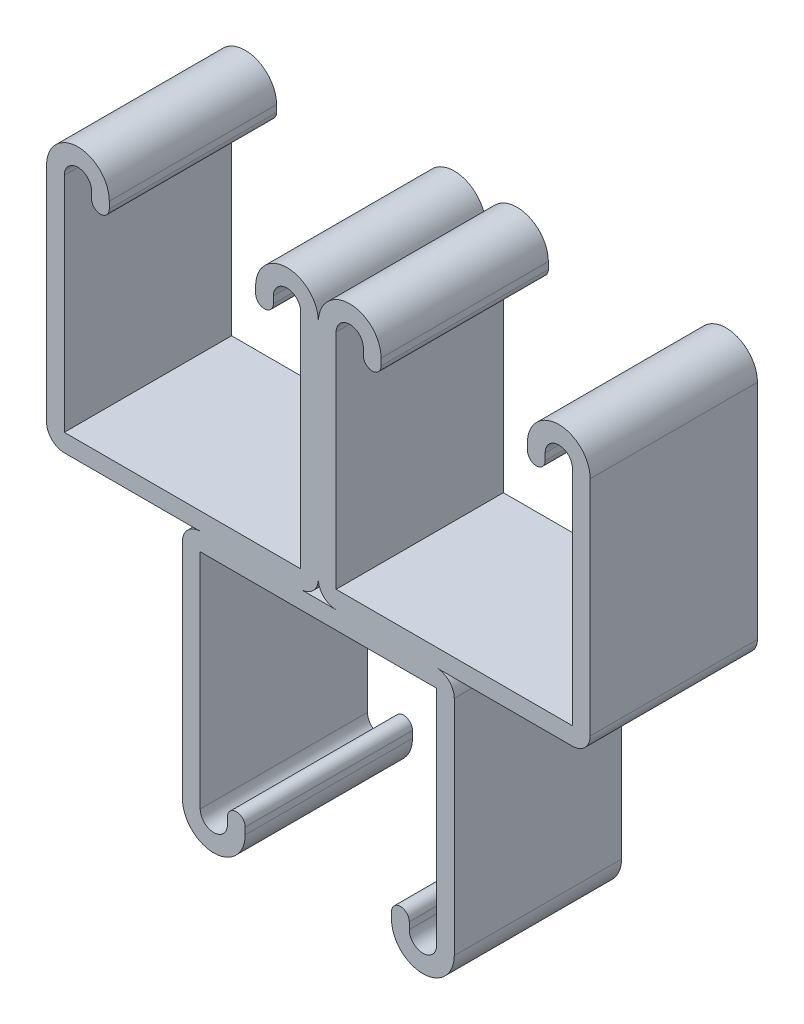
ISO-10303-21;
HEADER;
FILE_DESCRIPTION(('STEP AP214'),'2;1');
FILE_NAME('part.step','',(''),(''),'','','');
FILE_SCHEMA(('AUTOMOTIVE_DESIGN { 1 0 10303 214 1 1 1 1 }'));
ENDSEC;
DATA;
#1=APPLICATION_CONTEXT('core data for automotive mechanical design processes');
#2=APPLICATION_PROTOCOL_DEFINITION('international standard','automotive_design',2000,#1);
#3=PRODUCT_CONTEXT('',#1,'mechanical');
#4=PRODUCT('Part','Part','',(#3));
#5=PRODUCT_RELATED_PRODUCT_CATEGORY('part','',(#4));
#6=PRODUCT_DEFINITION_FORMATION('','',#4);
#7=PRODUCT_DEFINITION_CONTEXT('part definition',#1,'design');
#8=PRODUCT_DEFINITION('design','',#6,#7);
#9=PRODUCT_DEFINITION_SHAPE('','',#8);
#10=(LENGTH_UNIT() NAMED_UNIT(*) SI_UNIT(.MILLI.,.METRE.));
#11=(NAMED_UNIT(*) PLANE_ANGLE_UNIT() SI_UNIT($,.RADIAN.));
#12=(NAMED_UNIT(*) SI_UNIT($,.STERADIAN.) SOLID_ANGLE_UNIT());
#13=UNCERTAINTY_MEASURE_WITH_UNIT(LENGTH_MEASURE(1.E-05),#10,'distance_accuracy_value','');
#14=(GEOMETRIC_REPRESENTATION_CONTEXT(3) GLOBAL_UNCERTAINTY_ASSIGNED_CONTEXT((#13)) GLOBAL_UNIT_ASSIGNED_CONTEXT((#10,
#11,#12)) REPRESENTATION_CONTEXT('',''));
#15=CARTESIAN_POINT('',(0.,0.,0.));
#16=DIRECTION('',(0.,0.,1.));
#17=DIRECTION('',(1.,0.,0.));
#18=AXIS2_PLACEMENT_3D('',#15,#16,#17);
#19=CARTESIAN_POINT('',(28.26385,1.97365409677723E-13,12.7));
#20=DIRECTION('',(0.,-1.,0.));
#21=DIRECTION('',(1.,0.,0.));
#22=AXIS2_PLACEMENT_3D('',#19,#20,#21);
#23=PLANE('',#22);
#24=DIRECTION('',(0.,0.,-1.));
#25=VECTOR('',#24,1.);
#26=CARTESIAN_POINT('',(13.01115,0.,12.7));
#27=LINE('',#26,#25);
#28=CARTESIAN_POINT('',(13.01115,0.,12.7));
#29=VERTEX_POINT('',#28);
#30=CARTESIAN_POINT('',(13.01115,0.,-12.7));
#31=VERTEX_POINT('',#30);
#32=EDGE_CURVE('E398',#29,#31,#27,.T.);
#33=ORIENTED_EDGE('',*,*,#32,.T.);
#34=DIRECTION('',(-1.,0.,0.));
#35=VECTOR('',#34,1.);
#36=CARTESIAN_POINT('',(28.26385,1.97365409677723E-13,-12.7));
#37=LINE('',#36,#35);
#38=CARTESIAN_POINT('',(7.62635000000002,0.,-12.7));
#39=VERTEX_POINT('',#38);
#40=EDGE_CURVE('E619',#31,#39,#37,.T.);
#41=ORIENTED_EDGE('',*,*,#40,.T.);
#42=DIRECTION('',(0.,0.,-1.));
#43=VECTOR('',#42,1.);
#44=CARTESIAN_POINT('',(7.62635,0.,12.7));
#45=LINE('',#44,#43);
#46=CARTESIAN_POINT('',(7.62635,0.,12.7));
#47=VERTEX_POINT('',#46);
#48=EDGE_CURVE('E895',#47,#39,#45,.T.);
#49=ORIENTED_EDGE('',*,*,#48,.F.);
#50=DIRECTION('',(-1.,0.,0.));
#51=VECTOR('',#50,1.);
#52=CARTESIAN_POINT('',(28.26385,1.97365409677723E-13,12.7));
#53=LINE('',#52,#51);
#54=EDGE_CURVE('E60',#29,#47,#53,.T.);
#55=ORIENTED_EDGE('',*,*,#54,.F.);
#56=EDGE_LOOP('',(#33,#41,#49,#55));
#57=FACE_BOUND('',#56,.T.);
#58=ADVANCED_FACE('F41',(#57),#23,.F.);
#59=CARTESIAN_POINT('',(-26.19375,36.5125,12.7));
#60=DIRECTION('',(0.,0.,-1.));
#61=DIRECTION('',(-1.,0.,0.));
#62=AXIS2_PLACEMENT_3D('',#59,#60,#61);
#63=CYLINDRICAL_SURFACE('',#62,4.7625);
#64=CARTESIAN_POINT('',(-26.19375,36.5125,-12.7));
#65=DIRECTION('',(0.,0.,1.));
#66=DIRECTION('',(-1.,0.,0.));
#67=AXIS2_PLACEMENT_3D('',#64,#65,#66);
#68=CIRCLE('',#67,4.7625);
#69=CARTESIAN_POINT('',(-21.43125,36.5125,-12.7));
#70=VERTEX_POINT('',#69);
#71=CARTESIAN_POINT('',(-30.95625,36.5125,-12.7));
#72=VERTEX_POINT('',#71);
#73=EDGE_CURVE('E734',#70,#72,#68,.T.);
#74=ORIENTED_EDGE('',*,*,#73,.T.);
#75=DIRECTION('',(0.,0.,-1.));
#76=VECTOR('',#75,1.);
#77=CARTESIAN_POINT('',(-30.95625,36.5125,12.7));
#78=LINE('',#77,#76);
#79=CARTESIAN_POINT('',(-30.95625,36.5125,12.7));
#80=VERTEX_POINT('',#79);
#81=EDGE_CURVE('E11',#80,#72,#78,.T.);
#82=ORIENTED_EDGE('',*,*,#81,.F.);
#83=CARTESIAN_POINT('',(-26.19375,36.5125,12.7));
#84=DIRECTION('',(0.,0.,1.));
#85=DIRECTION('',(-1.,0.,0.));
#86=AXIS2_PLACEMENT_3D('',#83,#84,#85);
#87=CIRCLE('',#86,4.7625);
#88=CARTESIAN_POINT('',(-21.43125,36.5125,12.7));
#89=VERTEX_POINT('',#88);
#90=EDGE_CURVE('E732',#89,#80,#87,.T.);
#91=ORIENTED_EDGE('',*,*,#90,.F.);
#92=DIRECTION('',(0.,0.,-1.));
#93=VECTOR('',#92,1.);
#94=CARTESIAN_POINT('',(-21.43125,36.5125,12.7));
#95=LINE('',#94,#93);
#96=EDGE_CURVE('E788',#89,#70,#95,.T.);
#97=ORIENTED_EDGE('',*,*,#96,.T.);
#98=EDGE_LOOP('',(#74,#82,#91,#97));
#99=FACE_BOUND('',#98,.T.);
#100=ADVANCED_FACE('F43',(#99),#63,.T.);
#101=CARTESIAN_POINT('',(-30.95625,36.5125,12.7));
#102=DIRECTION('',(1.,0.,0.));
#103=DIRECTION('',(0.,1.,0.));
#104=AXIS2_PLACEMENT_3D('',#101,#102,#103);
#105=PLANE('',#104);
#106=DIRECTION('',(0.,-1.,0.));
#107=VECTOR('',#106,1.);
#108=CARTESIAN_POINT('',(-30.95625,36.5125,-12.7));
#109=LINE('',#108,#107);
#110=CARTESIAN_POINT('',(-30.95625,2.6924,-12.7));
#111=VERTEX_POINT('',#110);
#112=EDGE_CURVE('E787',#72,#111,#109,.T.);
#113=ORIENTED_EDGE('',*,*,#112,.T.);
#114=DIRECTION('',(0.,0.,-1.));
#115=VECTOR('',#114,1.);
#116=CARTESIAN_POINT('',(-30.95625,2.6924,12.7));
#117=LINE('',#116,#115);
#118=CARTESIAN_POINT('',(-30.95625,2.6924,12.7));
#119=VERTEX_POINT('',#118);
#120=EDGE_CURVE('E49',#119,#111,#117,.T.);
#121=ORIENTED_EDGE('',*,*,#120,.F.);
#122=DIRECTION('',(0.,-1.,0.));
#123=VECTOR('',#122,1.);
#124=CARTESIAN_POINT('',(-30.95625,36.5125,12.7));
#125=LINE('',#124,#123);
#126=EDGE_CURVE('E740',#80,#119,#125,.T.);
#127=ORIENTED_EDGE('',*,*,#126,.F.);
#128=ORIENTED_EDGE('',*,*,#81,.T.);
#129=EDGE_LOOP('',(#113,#121,#127,#128));
#130=FACE_BOUND('',#129,.T.);
#131=ADVANCED_FACE('F923',(#130),#105,.F.);
#132=CARTESIAN_POINT('',(-28.26385,2.6924,12.7));
#133=DIRECTION('',(0.,0.,-1.));
#134=DIRECTION('',(-1.,0.,0.));
#135=AXIS2_PLACEMENT_3D('',#132,#133,#134);
#136=CYLINDRICAL_SURFACE('',#135,2.6924);
#137=CARTESIAN_POINT('',(-28.26385,2.6924,-12.7));
#138=DIRECTION('',(0.,0.,1.));
#139=DIRECTION('',(-1.,0.,0.));
#140=AXIS2_PLACEMENT_3D('',#137,#138,#139);
#141=CIRCLE('',#140,2.6924);
#142=CARTESIAN_POINT('',(-28.26385,0.,-12.7));
#143=VERTEX_POINT('',#142);
#144=EDGE_CURVE('E791',#111,#143,#141,.T.);
#145=ORIENTED_EDGE('',*,*,#144,.T.);
#146=DIRECTION('',(0.,0.,-1.));
#147=VECTOR('',#146,1.);
#148=CARTESIAN_POINT('',(-28.26385,0.,12.7));
#149=LINE('',#148,#147);
#150=CARTESIAN_POINT('',(-28.26385,0.,12.7));
#151=VERTEX_POINT('',#150);
#152=EDGE_CURVE('E896',#151,#143,#149,.T.);
#153=ORIENTED_EDGE('',*,*,#152,.F.);
#154=CARTESIAN_POINT('',(-28.26385,2.6924,12.7));
#155=DIRECTION('',(0.,0.,1.));
#156=DIRECTION('',(-1.,0.,0.));
#157=AXIS2_PLACEMENT_3D('',#154,#155,#156);
#158=CIRCLE('',#157,2.6924);
#159=EDGE_CURVE('E743',#119,#151,#158,.T.);
#160=ORIENTED_EDGE('',*,*,#159,.F.);
#161=ORIENTED_EDGE('',*,*,#120,.T.);
#162=EDGE_LOOP('',(#145,#153,#160,#161));
#163=FACE_BOUND('',#162,.T.);
#164=ADVANCED_FACE('F908',(#163),#136,.T.);
#165=CARTESIAN_POINT('',(-28.26385,0.,12.7));
#166=DIRECTION('',(0.,1.,0.));
#167=DIRECTION('',(0.,0.,1.));
#168=AXIS2_PLACEMENT_3D('',#165,#166,#167);
#169=PLANE('',#168);
#170=DIRECTION('',(1.,0.,0.));
#171=VECTOR('',#170,1.);
#172=CARTESIAN_POINT('',(-28.26385,0.,-12.7));
#173=LINE('',#172,#171);
#174=CARTESIAN_POINT('',(-7.62634999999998,0.,-12.7));
#175=VERTEX_POINT('',#174);
#176=EDGE_CURVE('E798',#143,#175,#173,.T.);
#177=ORIENTED_EDGE('',*,*,#176,.T.);
#178=DIRECTION('',(0.,0.,-1.));
#179=VECTOR('',#178,1.);
#180=CARTESIAN_POINT('',(-7.62635,0.,12.7));
#181=LINE('',#180,#179);
#182=CARTESIAN_POINT('',(-7.62634999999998,0.,12.7));
#183=VERTEX_POINT('',#182);
#184=EDGE_CURVE('E61',#183,#175,#181,.T.);
#185=ORIENTED_EDGE('',*,*,#184,.F.);
#186=DIRECTION('',(1.,0.,0.));
#187=VECTOR('',#186,1.);
#188=CARTESIAN_POINT('',(-28.26385,0.,12.7));
#189=LINE('',#188,#187);
#190=EDGE_CURVE('E744',#151,#183,#189,.T.);
#191=ORIENTED_EDGE('',*,*,#190,.F.);
#192=ORIENTED_EDGE('',*,*,#152,.T.);
#193=EDGE_LOOP('',(#177,#185,#191,#192));
#194=FACE_BOUND('',#193,.T.);
#195=ADVANCED_FACE('F918',(#194),#169,.F.);
#196=CARTESIAN_POINT('',(7.62635,2.6924,12.7));
#197=DIRECTION('',(0.,0.,-1.));
#198=DIRECTION('',(-1.,0.,0.));
#199=AXIS2_PLACEMENT_3D('',#196,#197,#198);
#200=CYLINDRICAL_SURFACE('',#199,2.6924);
#201=CARTESIAN_POINT('',(7.62635,2.6924,-12.7));
#202=DIRECTION('',(0.,0.,1.));
#203=DIRECTION('',(1.,0.,0.));
#204=AXIS2_PLACEMENT_3D('',#201,#202,#203);
#205=CIRCLE('',#204,2.6924);
#206=CARTESIAN_POINT('',(10.31875,2.6924,-12.7));
#207=VERTEX_POINT('',#206);
#208=EDGE_CURVE('E800',#39,#207,#205,.T.);
#209=ORIENTED_EDGE('',*,*,#208,.T.);
#210=DIRECTION('',(0.,0.,-1.));
#211=VECTOR('',#210,1.);
#212=CARTESIAN_POINT('',(10.31875,2.6924,12.7));
#213=LINE('',#212,#211);
#214=CARTESIAN_POINT('',(10.31875,2.6924,12.7));
#215=VERTEX_POINT('',#214);
#216=EDGE_CURVE('E888',#215,#207,#213,.T.);
#217=ORIENTED_EDGE('',*,*,#216,.F.);
#218=CARTESIAN_POINT('',(7.62635,2.6924,12.7));
#219=DIRECTION('',(0.,0.,1.));
#220=DIRECTION('',(1.,0.,0.));
#221=AXIS2_PLACEMENT_3D('',#218,#219,#220);
#222=CIRCLE('',#221,2.6924);
#223=EDGE_CURVE('E747',#47,#215,#222,.T.);
#224=ORIENTED_EDGE('',*,*,#223,.F.);
#225=ORIENTED_EDGE('',*,*,#48,.T.);
#226=EDGE_LOOP('',(#209,#217,#224,#225));
#227=FACE_BOUND('',#226,.T.);
#228=ADVANCED_FACE('F1066',(#227),#200,.T.);
#229=CARTESIAN_POINT('',(5.55625,36.5125,12.7));
#230=DIRECTION('',(0.,0.,-1.));
#231=DIRECTION('',(-1.,0.,0.));
#232=AXIS2_PLACEMENT_3D('',#229,#230,#231);
#233=CYLINDRICAL_SURFACE('',#232,4.7625);
#234=CARTESIAN_POINT('',(5.55625,36.5125,-12.7));
#235=DIRECTION('',(0.,0.,1.));
#236=DIRECTION('',(1.,0.,0.));
#237=AXIS2_PLACEMENT_3D('',#234,#235,#236);
#238=CIRCLE('',#237,4.7625);
#239=CARTESIAN_POINT('',(10.31875,36.5125,-12.7));
#240=VERTEX_POINT('',#239);
#241=CARTESIAN_POINT('',(0.793749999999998,36.5125,-12.7));
#242=VERTEX_POINT('',#241);
#243=EDGE_CURVE('E805',#240,#242,#238,.T.);
#244=ORIENTED_EDGE('',*,*,#243,.T.);
#245=DIRECTION('',(0.,0.,-1.));
#246=VECTOR('',#245,1.);
#247=CARTESIAN_POINT('',(0.793749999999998,36.5125,12.7));
#248=LINE('',#247,#246);
#249=CARTESIAN_POINT('',(0.793749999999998,36.5125,12.7));
#250=VERTEX_POINT('',#249);
#251=EDGE_CURVE('E879',#250,#242,#248,.T.);
#252=ORIENTED_EDGE('',*,*,#251,.F.);
#253=CARTESIAN_POINT('',(5.55625,36.5125,12.7));
#254=DIRECTION('',(0.,0.,1.));
#255=DIRECTION('',(1.,0.,0.));
#256=AXIS2_PLACEMENT_3D('',#253,#254,#255);
#257=CIRCLE('',#256,4.7625);
#258=CARTESIAN_POINT('',(10.31875,36.5125,12.7));
#259=VERTEX_POINT('',#258);
#260=EDGE_CURVE('E749',#259,#250,#257,.T.);
#261=ORIENTED_EDGE('',*,*,#260,.F.);
#262=DIRECTION('',(0.,0.,-1.));
#263=VECTOR('',#262,1.);
#264=CARTESIAN_POINT('',(10.31875,36.5125,12.7));
#265=LINE('',#264,#263);
#266=EDGE_CURVE('E884',#259,#240,#265,.T.);
#267=ORIENTED_EDGE('',*,*,#266,.T.);
#268=EDGE_LOOP('',(#244,#252,#261,#267));
#269=FACE_BOUND('',#268,.T.);
#270=ADVANCED_FACE('F984',(#269),#233,.T.);
#271=CARTESIAN_POINT('',(0.793749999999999,36.5125,12.7));
#272=DIRECTION('',(1.,0.,0.));
#273=DIRECTION('',(0.,0.,-1.));
#274=AXIS2_PLACEMENT_3D('',#271,#272,#273);
#275=PLANE('',#274);
#276=DIRECTION('',(0.,-1.,0.));
#277=VECTOR('',#276,1.);
#278=CARTESIAN_POINT('',(0.793749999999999,36.5125,-12.7));
#279=LINE('',#278,#277);
#280=CARTESIAN_POINT('',(0.793749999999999,35.47745,-12.7));
#281=VERTEX_POINT('',#280);
#282=EDGE_CURVE('E804',#242,#281,#279,.T.);
#283=ORIENTED_EDGE('',*,*,#282,.T.);
#284=DIRECTION('',(0.,0.,-1.));
#285=VECTOR('',#284,1.);
#286=CARTESIAN_POINT('',(0.793749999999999,35.47745,12.7));
#287=LINE('',#286,#285);
#288=CARTESIAN_POINT('',(0.793749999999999,35.47745,12.7));
#289=VERTEX_POINT('',#288);
#290=EDGE_CURVE('E878',#289,#281,#287,.T.);
#291=ORIENTED_EDGE('',*,*,#290,.F.);
#292=DIRECTION('',(0.,-1.,0.));
#293=VECTOR('',#292,1.);
#294=CARTESIAN_POINT('',(0.793749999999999,36.5125,12.7));
#295=LINE('',#294,#293);
#296=EDGE_CURVE('E751',#250,#289,#295,.T.);
#297=ORIENTED_EDGE('',*,*,#296,.F.);
#298=ORIENTED_EDGE('',*,*,#251,.T.);
#299=EDGE_LOOP('',(#283,#291,#297,#298));
#300=FACE_BOUND('',#299,.T.);
#301=ADVANCED_FACE('F983',(#300),#275,.F.);
#302=CARTESIAN_POINT('',(2.13995,35.47745,12.7));
#303=DIRECTION('',(0.,0.,-1.));
#304=DIRECTION('',(-1.,0.,0.));
#305=AXIS2_PLACEMENT_3D('',#302,#303,#304);
#306=CYLINDRICAL_SURFACE('',#305,1.3462);
#307=CARTESIAN_POINT('',(2.13995,35.47745,-12.7));
#308=DIRECTION('',(0.,0.,1.));
#309=DIRECTION('',(1.,0.,0.));
#310=AXIS2_PLACEMENT_3D('',#307,#308,#309);
#311=CIRCLE('',#310,1.3462);
#312=CARTESIAN_POINT('',(3.48615,35.47745,-12.7));
#313=VERTEX_POINT('',#312);
#314=EDGE_CURVE('E806',#281,#313,#311,.T.);
#315=ORIENTED_EDGE('',*,*,#314,.T.);
#316=DIRECTION('',(0.,0.,-1.));
#317=VECTOR('',#316,1.);
#318=CARTESIAN_POINT('',(3.48615,35.47745,12.7));
#319=LINE('',#318,#317);
#320=CARTESIAN_POINT('',(3.48615,35.47745,12.7));
#321=VERTEX_POINT('',#320);
#322=EDGE_CURVE('E875',#321,#313,#319,.T.);
#323=ORIENTED_EDGE('',*,*,#322,.F.);
#324=CARTESIAN_POINT('',(2.13995,35.47745,12.7));
#325=DIRECTION('',(0.,0.,1.));
#326=DIRECTION('',(1.,0.,0.));
#327=AXIS2_PLACEMENT_3D('',#324,#325,#326);
#328=CIRCLE('',#327,1.3462);
#329=EDGE_CURVE('E756',#289,#321,#328,.T.);
#330=ORIENTED_EDGE('',*,*,#329,.F.);
#331=ORIENTED_EDGE('',*,*,#290,.T.);
#332=EDGE_LOOP('',(#315,#323,#330,#331));
#333=FACE_BOUND('',#332,.T.);
#334=ADVANCED_FACE('F976',(#333),#306,.T.);
#335=CARTESIAN_POINT('',(3.48615,36.5125,12.7));
#336=DIRECTION('',(-1.,0.,0.));
#337=DIRECTION('',(0.,0.,1.));
#338=AXIS2_PLACEMENT_3D('',#335,#336,#337);
#339=PLANE('',#338);
#340=DIRECTION('',(0.,1.,0.));
#341=VECTOR('',#340,1.);
#342=CARTESIAN_POINT('',(3.48615,36.5125,-12.7));
#343=LINE('',#342,#341);
#344=CARTESIAN_POINT('',(3.48615,36.5125,-12.7));
#345=VERTEX_POINT('',#344);
#346=EDGE_CURVE('E813',#313,#345,#343,.T.);
#347=ORIENTED_EDGE('',*,*,#346,.T.);
#348=DIRECTION('',(0.,0.,-1.));
#349=VECTOR('',#348,1.);
#350=CARTESIAN_POINT('',(3.48615,36.5125,12.7));
#351=LINE('',#350,#349);
#352=CARTESIAN_POINT('',(3.48615,36.5125,12.7));
#353=VERTEX_POINT('',#352);
#354=EDGE_CURVE('E867',#353,#345,#351,.T.);
#355=ORIENTED_EDGE('',*,*,#354,.F.);
#356=DIRECTION('',(0.,1.,0.));
#357=VECTOR('',#356,1.);
#358=CARTESIAN_POINT('',(3.48615,36.5125,12.7));
#359=LINE('',#358,#357);
#360=EDGE_CURVE('E757',#321,#353,#359,.T.);
#361=ORIENTED_EDGE('',*,*,#360,.F.);
#362=ORIENTED_EDGE('',*,*,#322,.T.);
#363=EDGE_LOOP('',(#347,#355,#361,#362));
#364=FACE_BOUND('',#363,.T.);
#365=ADVANCED_FACE('F973',(#364),#339,.F.);
#366=CARTESIAN_POINT('',(5.55625,36.5125,12.7));
#367=DIRECTION('',(0.,0.,-1.));
#368=DIRECTION('',(-1.,0.,0.));
#369=AXIS2_PLACEMENT_3D('',#366,#367,#368);
#370=CYLINDRICAL_SURFACE('',#369,2.0701);
#371=CARTESIAN_POINT('',(5.55625,36.5125,-12.7));
#372=DIRECTION('',(0.,0.,-1.));
#373=DIRECTION('',(1.,0.,0.));
#374=AXIS2_PLACEMENT_3D('',#371,#372,#373);
#375=CIRCLE('',#374,2.0701);
#376=CARTESIAN_POINT('',(7.62635,36.5125,-12.7));
#377=VERTEX_POINT('',#376);
#378=EDGE_CURVE('E815',#345,#377,#375,.T.);
#379=ORIENTED_EDGE('',*,*,#378,.T.);
#380=DIRECTION('',(0.,0.,-1.));
#381=VECTOR('',#380,1.);
#382=CARTESIAN_POINT('',(7.62635,36.5125,12.7));
#383=LINE('',#382,#381);
#384=CARTESIAN_POINT('',(7.62635,36.5125,12.7));
#385=VERTEX_POINT('',#384);
#386=EDGE_CURVE('E865',#385,#377,#383,.T.);
#387=ORIENTED_EDGE('',*,*,#386,.F.);
#388=CARTESIAN_POINT('',(5.55625,36.5125,12.7));
#389=DIRECTION('',(0.,0.,-1.));
#390=DIRECTION('',(1.,0.,0.));
#391=AXIS2_PLACEMENT_3D('',#388,#389,#390);
#392=CIRCLE('',#391,2.0701);
#393=EDGE_CURVE('E765',#353,#385,#392,.T.);
#394=ORIENTED_EDGE('',*,*,#393,.F.);
#395=ORIENTED_EDGE('',*,*,#354,.T.);
#396=EDGE_LOOP('',(#379,#387,#394,#395));
#397=FACE_BOUND('',#396,.T.);
#398=ADVANCED_FACE('F970',(#397),#370,.F.);
#399=CARTESIAN_POINT('',(7.62635,2.6924,12.7));
#400=DIRECTION('',(1.,0.,0.));
#401=DIRECTION('',(0.,0.,-1.));
#402=AXIS2_PLACEMENT_3D('',#399,#400,#401);
#403=PLANE('',#402);
#404=DIRECTION('',(0.,-1.,0.));
#405=VECTOR('',#404,1.);
#406=CARTESIAN_POINT('',(7.62635,2.6924,-12.7));
#407=LINE('',#406,#405);
#408=CARTESIAN_POINT('',(7.62635,2.6924,-12.7));
#409=VERTEX_POINT('',#408);
#410=EDGE_CURVE('E820',#377,#409,#407,.T.);
#411=ORIENTED_EDGE('',*,*,#410,.T.);
#412=DIRECTION('',(0.,0.,-1.));
#413=VECTOR('',#412,1.);
#414=CARTESIAN_POINT('',(7.62635,2.6924,12.7));
#415=LINE('',#414,#413);
#416=CARTESIAN_POINT('',(7.62635,2.6924,12.7));
#417=VERTEX_POINT('',#416);
#418=EDGE_CURVE('E858',#417,#409,#415,.T.);
#419=ORIENTED_EDGE('',*,*,#418,.F.);
#420=DIRECTION('',(0.,-1.,0.));
#421=VECTOR('',#420,1.);
#422=CARTESIAN_POINT('',(7.62635,2.6924,12.7));
#423=LINE('',#422,#421);
#424=EDGE_CURVE('E764',#385,#417,#423,.T.);
#425=ORIENTED_EDGE('',*,*,#424,.F.);
#426=ORIENTED_EDGE('',*,*,#386,.T.);
#427=EDGE_LOOP('',(#411,#419,#425,#426));
#428=FACE_BOUND('',#427,.T.);
#429=ADVANCED_FACE('F965',(#428),#403,.F.);
#430=CARTESIAN_POINT('',(-28.26385,2.6924,12.7));
#431=DIRECTION('',(0.,-1.,0.));
#432=DIRECTION('',(0.,0.,-1.));
#433=AXIS2_PLACEMENT_3D('',#430,#431,#432);
#434=PLANE('',#433);
#435=DIRECTION('',(-1.,0.,0.));
#436=VECTOR('',#435,1.);
#437=CARTESIAN_POINT('',(-28.26385,2.6924,-12.7));
#438=LINE('',#437,#436);
#439=CARTESIAN_POINT('',(-28.26385,2.6924,-12.7));
#440=VERTEX_POINT('',#439);
#441=EDGE_CURVE('E817',#409,#440,#438,.T.);
#442=ORIENTED_EDGE('',*,*,#441,.T.);
#443=DIRECTION('',(0.,0.,-1.));
#444=VECTOR('',#443,1.);
#445=CARTESIAN_POINT('',(-28.26385,2.6924,12.7));
#446=LINE('',#445,#444);
#447=CARTESIAN_POINT('',(-28.26385,2.6924,12.7));
#448=VERTEX_POINT('',#447);
#449=EDGE_CURVE('E857',#448,#440,#446,.T.);
#450=ORIENTED_EDGE('',*,*,#449,.F.);
#451=DIRECTION('',(-1.,0.,0.));
#452=VECTOR('',#451,1.);
#453=CARTESIAN_POINT('',(-28.26385,2.6924,12.7));
#454=LINE('',#453,#452);
#455=EDGE_CURVE('E767',#417,#448,#454,.T.);
#456=ORIENTED_EDGE('',*,*,#455,.F.);
#457=ORIENTED_EDGE('',*,*,#418,.T.);
#458=EDGE_LOOP('',(#442,#450,#456,#457));
#459=FACE_BOUND('',#458,.T.);
#460=ADVANCED_FACE('F956',(#459),#434,.F.);
#461=CARTESIAN_POINT('',(-28.26385,36.5125,12.7));
#462=DIRECTION('',(-1.,0.,0.));
#463=DIRECTION('',(0.,-1.,0.));
#464=AXIS2_PLACEMENT_3D('',#461,#462,#463);
#465=PLANE('',#464);
#466=DIRECTION('',(0.,1.,0.));
#467=VECTOR('',#466,1.);
#468=CARTESIAN_POINT('',(-28.26385,36.5125,-12.7));
#469=LINE('',#468,#467);
#470=CARTESIAN_POINT('',(-28.26385,36.5125,-12.7));
#471=VERTEX_POINT('',#470);
#472=EDGE_CURVE('E823',#440,#471,#469,.T.);
#473=ORIENTED_EDGE('',*,*,#472,.T.);
#474=DIRECTION('',(0.,0.,-1.));
#475=VECTOR('',#474,1.);
#476=CARTESIAN_POINT('',(-28.26385,36.5125,12.7));
#477=LINE('',#476,#475);
#478=CARTESIAN_POINT('',(-28.26385,36.5125,12.7));
#479=VERTEX_POINT('',#478);
#480=EDGE_CURVE('E855',#479,#471,#477,.T.);
#481=ORIENTED_EDGE('',*,*,#480,.F.);
#482=DIRECTION('',(0.,1.,0.));
#483=VECTOR('',#482,1.);
#484=CARTESIAN_POINT('',(-28.26385,36.5125,12.7));
#485=LINE('',#484,#483);
#486=EDGE_CURVE('E772',#448,#479,#485,.T.);
#487=ORIENTED_EDGE('',*,*,#486,.F.);
#488=ORIENTED_EDGE('',*,*,#449,.T.);
#489=EDGE_LOOP('',(#473,#481,#487,#488));
#490=FACE_BOUND('',#489,.T.);
#491=ADVANCED_FACE('F955',(#490),#465,.F.);
#492=CARTESIAN_POINT('',(-26.19375,36.5125,12.7));
#493=DIRECTION('',(0.,0.,-1.));
#494=DIRECTION('',(-1.,0.,0.));
#495=AXIS2_PLACEMENT_3D('',#492,#493,#494);
#496=CYLINDRICAL_SURFACE('',#495,2.0701);
#497=CARTESIAN_POINT('',(-26.19375,36.5125,-12.7));
#498=DIRECTION('',(0.,0.,-1.));
#499=DIRECTION('',(-1.,0.,0.));
#500=AXIS2_PLACEMENT_3D('',#497,#498,#499);
#501=CIRCLE('',#500,2.0701);
#502=CARTESIAN_POINT('',(-24.12365,36.5125,-12.7));
#503=VERTEX_POINT('',#502);
#504=EDGE_CURVE('E826',#471,#503,#501,.T.);
#505=ORIENTED_EDGE('',*,*,#504,.T.);
#506=DIRECTION('',(0.,0.,-1.));
#507=VECTOR('',#506,1.);
#508=CARTESIAN_POINT('',(-24.12365,36.5125,12.7));
#509=LINE('',#508,#507);
#510=CARTESIAN_POINT('',(-24.12365,36.5125,12.7));
#511=VERTEX_POINT('',#510);
#512=EDGE_CURVE('E847',#511,#503,#509,.T.);
#513=ORIENTED_EDGE('',*,*,#512,.F.);
#514=CARTESIAN_POINT('',(-26.19375,36.5125,12.7));
#515=DIRECTION('',(0.,0.,-1.));
#516=DIRECTION('',(-1.,0.,0.));
#517=AXIS2_PLACEMENT_3D('',#514,#515,#516);
#518=CIRCLE('',#517,2.0701);
#519=EDGE_CURVE('E771',#479,#511,#518,.T.);
#520=ORIENTED_EDGE('',*,*,#519,.F.);
#521=ORIENTED_EDGE('',*,*,#480,.T.);
#522=EDGE_LOOP('',(#505,#513,#520,#521));
#523=FACE_BOUND('',#522,.T.);
#524=ADVANCED_FACE('F950',(#523),#496,.F.);
#525=CARTESIAN_POINT('',(-24.12365,36.5125,12.7));
#526=DIRECTION('',(1.,0.,0.));
#527=DIRECTION('',(0.,0.,-1.));
#528=AXIS2_PLACEMENT_3D('',#525,#526,#527);
#529=PLANE('',#528);
#530=DIRECTION('',(0.,-1.,0.));
#531=VECTOR('',#530,1.);
#532=CARTESIAN_POINT('',(-24.12365,36.5125,-12.7));
#533=LINE('',#532,#531);
#534=CARTESIAN_POINT('',(-24.12365,35.47745,-12.7));
#535=VERTEX_POINT('',#534);
#536=EDGE_CURVE('E827',#503,#535,#533,.T.);
#537=ORIENTED_EDGE('',*,*,#536,.T.);
#538=DIRECTION('',(0.,0.,-1.));
#539=VECTOR('',#538,1.);
#540=CARTESIAN_POINT('',(-24.12365,35.47745,12.7));
#541=LINE('',#540,#539);
#542=CARTESIAN_POINT('',(-24.12365,35.47745,12.7));
#543=VERTEX_POINT('',#542);
#544=EDGE_CURVE('E845',#543,#535,#541,.T.);
#545=ORIENTED_EDGE('',*,*,#544,.F.);
#546=DIRECTION('',(0.,-1.,0.));
#547=VECTOR('',#546,1.);
#548=CARTESIAN_POINT('',(-24.12365,36.5125,12.7));
#549=LINE('',#548,#547);
#550=EDGE_CURVE('E779',#511,#543,#549,.T.);
#551=ORIENTED_EDGE('',*,*,#550,.F.);
#552=ORIENTED_EDGE('',*,*,#512,.T.);
#553=EDGE_LOOP('',(#537,#545,#551,#552));
#554=FACE_BOUND('',#553,.T.);
#555=ADVANCED_FACE('F943',(#554),#529,.F.);
#556=CARTESIAN_POINT('',(-22.77745,35.47745,12.7));
#557=DIRECTION('',(0.,0.,-1.));
#558=DIRECTION('',(-1.,0.,0.));
#559=AXIS2_PLACEMENT_3D('',#556,#557,#558);
#560=CYLINDRICAL_SURFACE('',#559,1.3462);
#561=CARTESIAN_POINT('',(-22.77745,35.47745,-12.7));
#562=DIRECTION('',(0.,0.,1.));
#563=DIRECTION('',(-1.,0.,0.));
#564=AXIS2_PLACEMENT_3D('',#561,#562,#563);
#565=CIRCLE('',#564,1.3462);
#566=CARTESIAN_POINT('',(-21.43125,35.47745,-12.7));
#567=VERTEX_POINT('',#566);
#568=EDGE_CURVE('E835',#535,#567,#565,.T.);
#569=ORIENTED_EDGE('',*,*,#568,.T.);
#570=DIRECTION('',(0.,0.,-1.));
#571=VECTOR('',#570,1.);
#572=CARTESIAN_POINT('',(-21.43125,35.47745,12.7));
#573=LINE('',#572,#571);
#574=CARTESIAN_POINT('',(-21.43125,35.47745,12.7));
#575=VERTEX_POINT('',#574);
#576=EDGE_CURVE('E838',#575,#567,#573,.T.);
#577=ORIENTED_EDGE('',*,*,#576,.F.);
#578=CARTESIAN_POINT('',(-22.77745,35.47745,12.7));
#579=DIRECTION('',(0.,0.,1.));
#580=DIRECTION('',(-1.,0.,0.));
#581=AXIS2_PLACEMENT_3D('',#578,#579,#580);
#582=CIRCLE('',#581,1.3462);
#583=EDGE_CURVE('E776',#543,#575,#582,.T.);
#584=ORIENTED_EDGE('',*,*,#583,.F.);
#585=ORIENTED_EDGE('',*,*,#544,.T.);
#586=EDGE_LOOP('',(#569,#577,#584,#585));
#587=FACE_BOUND('',#586,.T.);
#588=ADVANCED_FACE('F940',(#587),#560,.T.);
#589=CARTESIAN_POINT('',(-21.43125,36.5125,12.7));
#590=DIRECTION('',(-1.,0.,0.));
#591=DIRECTION('',(0.,0.,1.));
#592=AXIS2_PLACEMENT_3D('',#589,#590,#591);
#593=PLANE('',#592);
#594=DIRECTION('',(0.,1.,0.));
#595=VECTOR('',#594,1.);
#596=CARTESIAN_POINT('',(-21.43125,36.5125,-12.7));
#597=LINE('',#596,#595);
#598=EDGE_CURVE('E737',#567,#70,#597,.T.);
#599=ORIENTED_EDGE('',*,*,#598,.T.);
#600=ORIENTED_EDGE('',*,*,#96,.F.);
#601=DIRECTION('',(0.,1.,0.));
#602=VECTOR('',#601,1.);
#603=CARTESIAN_POINT('',(-21.43125,36.5125,12.7));
#604=LINE('',#603,#602);
#605=EDGE_CURVE('E782',#575,#89,#604,.T.);
#606=ORIENTED_EDGE('',*,*,#605,.F.);
#607=ORIENTED_EDGE('',*,*,#576,.T.);
#608=EDGE_LOOP('',(#599,#600,#606,#607));
#609=FACE_BOUND('',#608,.T.);
#610=ADVANCED_FACE('F935',(#609),#593,.F.);
#611=CARTESIAN_POINT('',(-26.19375,36.5125,12.7));
#612=DIRECTION('',(0.,0.,-1.));
#613=DIRECTION('',(-1.,0.,0.));
#614=AXIS2_PLACEMENT_3D('',#611,#612,#613);
#615=PLANE('',#614);
#616=CARTESIAN_POINT('',(15.08125,36.5125,12.7));
#617=DIRECTION('',(0.,0.,1.));
#618=DIRECTION('',(-1.,0.,0.));
#619=AXIS2_PLACEMENT_3D('',#616,#617,#618);
#620=CIRCLE('',#619,4.7625);
#621=CARTESIAN_POINT('',(19.84375,36.5125,12.7));
#622=VERTEX_POINT('',#621);
#623=EDGE_CURVE('E497',#622,#259,#620,.T.);
#624=ORIENTED_EDGE('',*,*,#623,.T.);
#625=ORIENTED_EDGE('',*,*,#260,.T.);
#626=ORIENTED_EDGE('',*,*,#296,.T.);
#627=ORIENTED_EDGE('',*,*,#329,.T.);
#628=ORIENTED_EDGE('',*,*,#360,.T.);
#629=ORIENTED_EDGE('',*,*,#393,.T.);
#630=ORIENTED_EDGE('',*,*,#424,.T.);
#631=ORIENTED_EDGE('',*,*,#455,.T.);
#632=ORIENTED_EDGE('',*,*,#486,.T.);
#633=ORIENTED_EDGE('',*,*,#519,.T.);
#634=ORIENTED_EDGE('',*,*,#550,.T.);
#635=ORIENTED_EDGE('',*,*,#583,.T.);
#636=ORIENTED_EDGE('',*,*,#605,.T.);
#637=ORIENTED_EDGE('',*,*,#90,.T.);
#638=ORIENTED_EDGE('',*,*,#126,.T.);
#639=ORIENTED_EDGE('',*,*,#159,.T.);
#640=ORIENTED_EDGE('',*,*,#190,.T.);
#641=CARTESIAN_POINT('',(-7.62634999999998,-2.69240000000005,12.7));
#642=DIRECTION('',(0.,0.,1.));
#643=DIRECTION('',(-1.,0.,0.));
#644=AXIS2_PLACEMENT_3D('',#641,#642,#643);
#645=CIRCLE('',#644,2.6924);
#646=CARTESIAN_POINT('',(-10.31875,-2.69240000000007,12.7));
#647=VERTEX_POINT('',#646);
#648=EDGE_CURVE('E568',#183,#647,#645,.T.);
#649=ORIENTED_EDGE('',*,*,#648,.T.);
#650=DIRECTION('',(0.,-1.,0.));
#651=VECTOR('',#650,1.);
#652=CARTESIAN_POINT('',(-10.31875,-2.69240000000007,12.7));
#653=LINE('',#652,#651);
#654=CARTESIAN_POINT('',(-10.3187499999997,-36.5125000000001,12.7));
#655=VERTEX_POINT('',#654);
#656=EDGE_CURVE('E571',#647,#655,#653,.T.);
#657=ORIENTED_EDGE('',*,*,#656,.T.);
#658=CARTESIAN_POINT('',(-5.55624999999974,-36.5125,12.7));
#659=DIRECTION('',(0.,0.,1.));
#660=DIRECTION('',(-1.,0.,0.));
#661=AXIS2_PLACEMENT_3D('',#658,#659,#660);
#662=CIRCLE('',#661,4.7625);
#663=CARTESIAN_POINT('',(-0.793749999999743,-36.5125,12.7));
#664=VERTEX_POINT('',#663);
#665=EDGE_CURVE('E573',#655,#664,#662,.T.);
#666=ORIENTED_EDGE('',*,*,#665,.T.);
#667=DIRECTION('',(0.,1.,0.));
#668=VECTOR('',#667,1.);
#669=CARTESIAN_POINT('',(-0.793749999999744,-36.5125,12.7));
#670=LINE('',#669,#668);
#671=CARTESIAN_POINT('',(-0.793749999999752,-35.47745,12.7));
#672=VERTEX_POINT('',#671);
#673=EDGE_CURVE('E580',#664,#672,#670,.T.);
#674=ORIENTED_EDGE('',*,*,#673,.T.);
#675=CARTESIAN_POINT('',(-2.13994999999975,-35.47745,12.7));
#676=DIRECTION('',(0.,0.,1.));
#677=DIRECTION('',(-1.,0.,0.));
#678=AXIS2_PLACEMENT_3D('',#675,#676,#677);
#679=CIRCLE('',#678,1.3462);
#680=CARTESIAN_POINT('',(-3.48614999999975,-35.47745,12.7));
#681=VERTEX_POINT('',#680);
#682=EDGE_CURVE('E578',#672,#681,#679,.T.);
#683=ORIENTED_EDGE('',*,*,#682,.T.);
#684=DIRECTION('',(0.,-1.,0.));
#685=VECTOR('',#684,1.);
#686=CARTESIAN_POINT('',(-3.48614999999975,-36.5125,12.7));
#687=LINE('',#686,#685);
#688=CARTESIAN_POINT('',(-3.48614999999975,-36.5125,12.7));
#689=VERTEX_POINT('',#688);
#690=EDGE_CURVE('E582',#681,#689,#687,.T.);
#691=ORIENTED_EDGE('',*,*,#690,.T.);
#692=CARTESIAN_POINT('',(-5.55624999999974,-36.5125,12.7));
#693=DIRECTION('',(0.,0.,-1.));
#694=DIRECTION('',(-1.,0.,0.));
#695=AXIS2_PLACEMENT_3D('',#692,#693,#694);
#696=CIRCLE('',#695,2.0701);
#697=CARTESIAN_POINT('',(-7.62634999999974,-36.5125000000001,12.7));
#698=VERTEX_POINT('',#697);
#699=EDGE_CURVE('E586',#689,#698,#696,.T.);
#700=ORIENTED_EDGE('',*,*,#699,.T.);
#701=DIRECTION('',(0.,1.,0.));
#702=VECTOR('',#701,1.);
#703=CARTESIAN_POINT('',(-7.62634999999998,-2.69240000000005,12.7));
#704=LINE('',#703,#702);
#705=CARTESIAN_POINT('',(-7.62634999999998,-2.69240000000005,12.7));
#706=VERTEX_POINT('',#705);
#707=EDGE_CURVE('E588',#698,#706,#704,.T.);
#708=ORIENTED_EDGE('',*,*,#707,.T.);
#709=DIRECTION('',(1.,0.,0.));
#710=VECTOR('',#709,1.);
#711=CARTESIAN_POINT('',(28.26385,-2.6923999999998,12.7));
#712=LINE('',#711,#710);
#713=CARTESIAN_POINT('',(28.26385,-2.6923999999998,12.7));
#714=VERTEX_POINT('',#713);
#715=EDGE_CURVE('E595',#706,#714,#712,.T.);
#716=ORIENTED_EDGE('',*,*,#715,.T.);
#717=DIRECTION('',(0.,-1.,0.));
#718=VECTOR('',#717,1.);
#719=CARTESIAN_POINT('',(28.2638500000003,-36.5124999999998,12.7));
#720=LINE('',#719,#718);
#721=CARTESIAN_POINT('',(28.2638500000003,-36.5124999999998,12.7));
#722=VERTEX_POINT('',#721);
#723=EDGE_CURVE('E592',#714,#722,#720,.T.);
#724=ORIENTED_EDGE('',*,*,#723,.T.);
#725=CARTESIAN_POINT('',(26.1937500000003,-36.5124999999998,12.7));
#726=DIRECTION('',(0.,0.,-1.));
#727=DIRECTION('',(1.,0.,0.));
#728=AXIS2_PLACEMENT_3D('',#725,#726,#727);
#729=CIRCLE('',#728,2.0701);
#730=CARTESIAN_POINT('',(24.1236500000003,-36.5124999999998,12.7));
#731=VERTEX_POINT('',#730);
#732=EDGE_CURVE('E596',#722,#731,#729,.T.);
#733=ORIENTED_EDGE('',*,*,#732,.T.);
#734=DIRECTION('',(0.,1.,0.));
#735=VECTOR('',#734,1.);
#736=CARTESIAN_POINT('',(24.1236500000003,-36.5124999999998,12.7));
#737=LINE('',#736,#735);
#738=CARTESIAN_POINT('',(24.1236500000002,-35.4774499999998,12.7));
#739=VERTEX_POINT('',#738);
#740=EDGE_CURVE('E603',#731,#739,#737,.T.);
#741=ORIENTED_EDGE('',*,*,#740,.T.);
#742=CARTESIAN_POINT('',(22.7774500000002,-35.4774499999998,12.7));
#743=DIRECTION('',(0.,0.,1.));
#744=DIRECTION('',(1.,0.,0.));
#745=AXIS2_PLACEMENT_3D('',#742,#743,#744);
#746=CIRCLE('',#745,1.3462);
#747=CARTESIAN_POINT('',(21.4312500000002,-35.4774499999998,12.7));
#748=VERTEX_POINT('',#747);
#749=EDGE_CURVE('E605',#739,#748,#746,.T.);
#750=ORIENTED_EDGE('',*,*,#749,.T.);
#751=DIRECTION('',(0.,-1.,0.));
#752=VECTOR('',#751,1.);
#753=CARTESIAN_POINT('',(21.4312500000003,-36.5124999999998,12.7));
#754=LINE('',#753,#752);
#755=CARTESIAN_POINT('',(21.4312500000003,-36.5124999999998,12.7));
#756=VERTEX_POINT('',#755);
#757=EDGE_CURVE('E610',#748,#756,#754,.T.);
#758=ORIENTED_EDGE('',*,*,#757,.T.);
#759=CARTESIAN_POINT('',(26.1937500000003,-36.5124999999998,12.7));
#760=DIRECTION('',(0.,0.,1.));
#761=DIRECTION('',(1.,0.,0.));
#762=AXIS2_PLACEMENT_3D('',#759,#760,#761);
#763=CIRCLE('',#762,4.7625);
#764=CARTESIAN_POINT('',(30.9562500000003,-36.5124999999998,12.7));
#765=VERTEX_POINT('',#764);
#766=EDGE_CURVE('E558',#756,#765,#763,.T.);
#767=ORIENTED_EDGE('',*,*,#766,.T.);
#768=DIRECTION('',(0.,1.,0.));
#769=VECTOR('',#768,1.);
#770=CARTESIAN_POINT('',(30.9562500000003,-36.5124999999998,12.7));
#771=LINE('',#770,#769);
#772=CARTESIAN_POINT('',(30.95625,-2.69239999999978,12.7));
#773=VERTEX_POINT('',#772);
#774=EDGE_CURVE('E557',#765,#773,#771,.T.);
#775=ORIENTED_EDGE('',*,*,#774,.T.);
#776=CARTESIAN_POINT('',(28.26385,-2.6923999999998,12.7));
#777=DIRECTION('',(0.,0.,1.));
#778=DIRECTION('',(1.,0.,0.));
#779=AXIS2_PLACEMENT_3D('',#776,#777,#778);
#780=CIRCLE('',#779,2.6924);
#781=CARTESIAN_POINT('',(28.26385,2.00834856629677E-13,12.7));
#782=VERTEX_POINT('',#781);
#783=EDGE_CURVE('E382',#773,#782,#780,.T.);
#784=ORIENTED_EDGE('',*,*,#783,.T.);
#785=DIRECTION('',(1.,0.,0.));
#786=VECTOR('',#785,1.);
#787=CARTESIAN_POINT('',(13.01115,0.,12.7));
#788=LINE('',#787,#786);
#789=CARTESIAN_POINT('',(48.90135,0.,12.7));
#790=VERTEX_POINT('',#789);
#791=EDGE_CURVE('E375',#782,#790,#788,.T.);
#792=ORIENTED_EDGE('',*,*,#791,.T.);
#793=CARTESIAN_POINT('',(48.90135,2.69240000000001,12.7));
#794=DIRECTION('',(0.,0.,1.));
#795=DIRECTION('',(1.,0.,0.));
#796=AXIS2_PLACEMENT_3D('',#793,#794,#795);
#797=CIRCLE('',#796,2.6924);
#798=CARTESIAN_POINT('',(51.59375,2.69240000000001,12.7));
#799=VERTEX_POINT('',#798);
#800=EDGE_CURVE('E377',#790,#799,#797,.T.);
#801=ORIENTED_EDGE('',*,*,#800,.T.);
#802=DIRECTION('',(0.,1.,0.));
#803=VECTOR('',#802,1.);
#804=CARTESIAN_POINT('',(51.59375,2.69240000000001,12.7));
#805=LINE('',#804,#803);
#806=CARTESIAN_POINT('',(51.59375,36.5125,12.7));
#807=VERTEX_POINT('',#806);
#808=EDGE_CURVE('E401',#799,#807,#805,.T.);
#809=ORIENTED_EDGE('',*,*,#808,.T.);
#810=CARTESIAN_POINT('',(46.83125,36.5125,12.7));
#811=DIRECTION('',(0.,0.,1.));
#812=DIRECTION('',(1.,0.,0.));
#813=AXIS2_PLACEMENT_3D('',#810,#811,#812);
#814=CIRCLE('',#813,4.7625);
#815=CARTESIAN_POINT('',(42.06875,36.5125,12.7));
#816=VERTEX_POINT('',#815);
#817=EDGE_CURVE('E409',#807,#816,#814,.T.);
#818=ORIENTED_EDGE('',*,*,#817,.T.);
#819=DIRECTION('',(0.,-1.,0.));
#820=VECTOR('',#819,1.);
#821=CARTESIAN_POINT('',(42.06875,36.5125,12.7));
#822=LINE('',#821,#820);
#823=CARTESIAN_POINT('',(42.06875,35.47745,12.7));
#824=VERTEX_POINT('',#823);
#825=EDGE_CURVE('E412',#816,#824,#822,.T.);
#826=ORIENTED_EDGE('',*,*,#825,.T.);
#827=CARTESIAN_POINT('',(43.41495,35.47745,12.7));
#828=DIRECTION('',(0.,0.,1.));
#829=DIRECTION('',(1.,0.,0.));
#830=AXIS2_PLACEMENT_3D('',#827,#828,#829);
#831=CIRCLE('',#830,1.3462);
#832=CARTESIAN_POINT('',(44.76115,35.47745,12.7));
#833=VERTEX_POINT('',#832);
#834=EDGE_CURVE('E418',#824,#833,#831,.T.);
#835=ORIENTED_EDGE('',*,*,#834,.T.);
#836=DIRECTION('',(0.,1.,0.));
#837=VECTOR('',#836,1.);
#838=CARTESIAN_POINT('',(44.76115,36.5125,12.7));
#839=LINE('',#838,#837);
#840=CARTESIAN_POINT('',(44.76115,36.5125,12.7));
#841=VERTEX_POINT('',#840);
#842=EDGE_CURVE('E419',#833,#841,#839,.T.);
#843=ORIENTED_EDGE('',*,*,#842,.T.);
#844=CARTESIAN_POINT('',(46.83125,36.5125,12.7));
#845=DIRECTION('',(0.,0.,-1.));
#846=DIRECTION('',(1.,0.,0.));
#847=AXIS2_PLACEMENT_3D('',#844,#845,#846);
#848=CIRCLE('',#847,2.0701);
#849=CARTESIAN_POINT('',(48.90135,36.5125,12.7));
#850=VERTEX_POINT('',#849);
#851=EDGE_CURVE('E422',#841,#850,#848,.T.);
#852=ORIENTED_EDGE('',*,*,#851,.T.);
#853=DIRECTION('',(0.,-1.,0.));
#854=VECTOR('',#853,1.);
#855=CARTESIAN_POINT('',(48.90135,2.69240000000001,12.7));
#856=LINE('',#855,#854);
#857=CARTESIAN_POINT('',(48.90135,2.69240000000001,12.7));
#858=VERTEX_POINT('',#857);
#859=EDGE_CURVE('E424',#850,#858,#856,.T.);
#860=ORIENTED_EDGE('',*,*,#859,.T.);
#861=DIRECTION('',(-1.,0.,0.));
#862=VECTOR('',#861,1.);
#863=CARTESIAN_POINT('',(13.01115,2.69240000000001,12.7));
#864=LINE('',#863,#862);
#865=CARTESIAN_POINT('',(13.01115,2.69240000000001,12.7));
#866=VERTEX_POINT('',#865);
#867=EDGE_CURVE('E426',#858,#866,#864,.T.);
#868=ORIENTED_EDGE('',*,*,#867,.T.);
#869=DIRECTION('',(0.,1.,0.));
#870=VECTOR('',#869,1.);
#871=CARTESIAN_POINT('',(13.01115,36.5125,12.7));
#872=LINE('',#871,#870);
#873=CARTESIAN_POINT('',(13.01115,36.5125,12.7));
#874=VERTEX_POINT('',#873);
#875=EDGE_CURVE('E431',#866,#874,#872,.T.);
#876=ORIENTED_EDGE('',*,*,#875,.T.);
#877=CARTESIAN_POINT('',(15.08125,36.5125,12.7));
#878=DIRECTION('',(0.,0.,-1.));
#879=DIRECTION('',(-1.,0.,0.));
#880=AXIS2_PLACEMENT_3D('',#877,#878,#879);
#881=CIRCLE('',#880,2.0701);
#882=CARTESIAN_POINT('',(17.15135,36.5125,12.7));
#883=VERTEX_POINT('',#882);
#884=EDGE_CURVE('E432',#874,#883,#881,.T.);
#885=ORIENTED_EDGE('',*,*,#884,.T.);
#886=DIRECTION('',(0.,-1.,0.));
#887=VECTOR('',#886,1.);
#888=CARTESIAN_POINT('',(17.15135,36.5125,12.7));
#889=LINE('',#888,#887);
#890=CARTESIAN_POINT('',(17.15135,35.47745,12.7));
#891=VERTEX_POINT('',#890);
#892=EDGE_CURVE('E440',#883,#891,#889,.T.);
#893=ORIENTED_EDGE('',*,*,#892,.T.);
#894=CARTESIAN_POINT('',(18.49755,35.47745,12.7));
#895=DIRECTION('',(0.,0.,1.));
#896=DIRECTION('',(-1.,0.,0.));
#897=AXIS2_PLACEMENT_3D('',#894,#895,#896);
#898=CIRCLE('',#897,1.3462);
#899=CARTESIAN_POINT('',(19.84375,35.47745,12.7));
#900=VERTEX_POINT('',#899);
#901=EDGE_CURVE('E439',#891,#900,#898,.T.);
#902=ORIENTED_EDGE('',*,*,#901,.T.);
#903=DIRECTION('',(0.,1.,0.));
#904=VECTOR('',#903,1.);
#905=CARTESIAN_POINT('',(19.84375,36.5125,12.7));
#906=LINE('',#905,#904);
#907=EDGE_CURVE('E442',#900,#622,#906,.T.);
#908=ORIENTED_EDGE('',*,*,#907,.T.);
#909=EDGE_LOOP('',(#624,#625,#626,#627,#628,#629,#630,#631,#632,#633,#634,#635,#636,#637,#638,
#639,#640,#649,#657,#666,#674,#683,#691,#700,#708,#716,#724,#733,#741,#750,#758,#767,#775,#784,
#792,#801,#809,#818,#826,#835,#843,#852,#860,#868,#876,#885,#893,#902,#908));
#910=FACE_BOUND('',#909,.T.);
#911=ORIENTED_EDGE('',*,*,#223,.T.);
#912=CARTESIAN_POINT('',(13.01115,2.6924,12.7));
#913=DIRECTION('',(0.,0.,1.));
#914=DIRECTION('',(-1.,0.,0.));
#915=AXIS2_PLACEMENT_3D('',#912,#913,#914);
#916=CIRCLE('',#915,2.6924);
#917=EDGE_CURVE('E388',#215,#29,#916,.T.);
#918=ORIENTED_EDGE('',*,*,#917,.T.);
#919=ORIENTED_EDGE('',*,*,#54,.T.);
#920=EDGE_LOOP('',(#911,#918,#919));
#921=FACE_BOUND('',#920,.T.);
#922=ADVANCED_FACE('F374',(#910,#921),#615,.F.);
#923=CARTESIAN_POINT('',(-26.19375,36.5125,-12.7));
#924=DIRECTION('',(0.,0.,-1.));
#925=DIRECTION('',(-1.,0.,0.));
#926=AXIS2_PLACEMENT_3D('',#923,#924,#925);
#927=PLANE('',#926);
#928=ORIENTED_EDGE('',*,*,#243,.F.);
#929=CARTESIAN_POINT('',(15.08125,36.5125,-12.7));
#930=DIRECTION('',(0.,0.,1.));
#931=DIRECTION('',(-1.,0.,0.));
#932=AXIS2_PLACEMENT_3D('',#929,#930,#931);
#933=CIRCLE('',#932,4.7625);
#934=CARTESIAN_POINT('',(19.84375,36.5125,-12.7));
#935=VERTEX_POINT('',#934);
#936=EDGE_CURVE('E450',#935,#240,#933,.T.);
#937=ORIENTED_EDGE('',*,*,#936,.F.);
#938=DIRECTION('',(0.,1.,0.));
#939=VECTOR('',#938,1.);
#940=CARTESIAN_POINT('',(19.84375,36.5125,-12.7));
#941=LINE('',#940,#939);
#942=CARTESIAN_POINT('',(19.84375,35.47745,-12.7));
#943=VERTEX_POINT('',#942);
#944=EDGE_CURVE('E496',#943,#935,#941,.T.);
#945=ORIENTED_EDGE('',*,*,#944,.F.);
#946=CARTESIAN_POINT('',(18.49755,35.47745,-12.7));
#947=DIRECTION('',(0.,0.,1.));
#948=DIRECTION('',(-1.,0.,0.));
#949=AXIS2_PLACEMENT_3D('',#946,#947,#948);
#950=CIRCLE('',#949,1.3462);
#951=CARTESIAN_POINT('',(17.15135,35.47745,-12.7));
#952=VERTEX_POINT('',#951);
#953=EDGE_CURVE('E491',#952,#943,#950,.T.);
#954=ORIENTED_EDGE('',*,*,#953,.F.);
#955=DIRECTION('',(0.,-1.,0.));
#956=VECTOR('',#955,1.);
#957=CARTESIAN_POINT('',(17.15135,36.5125,-12.7));
#958=LINE('',#957,#956);
#959=CARTESIAN_POINT('',(17.15135,36.5125,-12.7));
#960=VERTEX_POINT('',#959);
#961=EDGE_CURVE('E489',#960,#952,#958,.T.);
#962=ORIENTED_EDGE('',*,*,#961,.F.);
#963=CARTESIAN_POINT('',(15.08125,36.5125,-12.7));
#964=DIRECTION('',(0.,0.,-1.));
#965=DIRECTION('',(-1.,0.,0.));
#966=AXIS2_PLACEMENT_3D('',#963,#964,#965);
#967=CIRCLE('',#966,2.0701);
#968=CARTESIAN_POINT('',(13.01115,36.5125,-12.7));
#969=VERTEX_POINT('',#968);
#970=EDGE_CURVE('E487',#969,#960,#967,.T.);
#971=ORIENTED_EDGE('',*,*,#970,.F.);
#972=DIRECTION('',(0.,1.,0.));
#973=VECTOR('',#972,1.);
#974=CARTESIAN_POINT('',(13.01115,36.5125,-12.7));
#975=LINE('',#974,#973);
#976=CARTESIAN_POINT('',(13.01115,2.69240000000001,-12.7));
#977=VERTEX_POINT('',#976);
#978=EDGE_CURVE('E484',#977,#969,#975,.T.);
#979=ORIENTED_EDGE('',*,*,#978,.F.);
#980=DIRECTION('',(-1.,0.,0.));
#981=VECTOR('',#980,1.);
#982=CARTESIAN_POINT('',(13.01115,2.69240000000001,-12.7));
#983=LINE('',#982,#981);
#984=CARTESIAN_POINT('',(48.90135,2.69240000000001,-12.7));
#985=VERTEX_POINT('',#984);
#986=EDGE_CURVE('E483',#985,#977,#983,.T.);
#987=ORIENTED_EDGE('',*,*,#986,.F.);
#988=DIRECTION('',(0.,-1.,0.));
#989=VECTOR('',#988,1.);
#990=CARTESIAN_POINT('',(48.90135,2.69240000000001,-12.7));
#991=LINE('',#990,#989);
#992=CARTESIAN_POINT('',(48.90135,36.5125,-12.7));
#993=VERTEX_POINT('',#992);
#994=EDGE_CURVE('E477',#993,#985,#991,.T.);
#995=ORIENTED_EDGE('',*,*,#994,.F.);
#996=CARTESIAN_POINT('',(46.83125,36.5125,-12.7));
#997=DIRECTION('',(0.,0.,-1.));
#998=DIRECTION('',(1.,0.,0.));
#999=AXIS2_PLACEMENT_3D('',#996,#997,#998);
#1000=CIRCLE('',#999,2.0701);
#1001=CARTESIAN_POINT('',(44.76115,36.5125,-12.7));
#1002=VERTEX_POINT('',#1001);
#1003=EDGE_CURVE('E471',#1002,#993,#1000,.T.);
#1004=ORIENTED_EDGE('',*,*,#1003,.F.);
#1005=DIRECTION('',(0.,1.,0.));
#1006=VECTOR('',#1005,1.);
#1007=CARTESIAN_POINT('',(44.76115,36.5125,-12.7));
#1008=LINE('',#1007,#1006);
#1009=CARTESIAN_POINT('',(44.76115,35.47745,-12.7));
#1010=VERTEX_POINT('',#1009);
#1011=EDGE_CURVE('E474',#1010,#1002,#1008,.T.);
#1012=ORIENTED_EDGE('',*,*,#1011,.F.);
#1013=CARTESIAN_POINT('',(43.41495,35.47745,-12.7));
#1014=DIRECTION('',(0.,0.,1.));
#1015=DIRECTION('',(1.,0.,0.));
#1016=AXIS2_PLACEMENT_3D('',#1013,#1014,#1015);
#1017=CIRCLE('',#1016,1.3462);
#1018=CARTESIAN_POINT('',(42.06875,35.47745,-12.7));
#1019=VERTEX_POINT('',#1018);
#1020=EDGE_CURVE('E469',#1019,#1010,#1017,.T.);
#1021=ORIENTED_EDGE('',*,*,#1020,.F.);
#1022=DIRECTION('',(0.,-1.,0.));
#1023=VECTOR('',#1022,1.);
#1024=CARTESIAN_POINT('',(42.06875,36.5125,-12.7));
#1025=LINE('',#1024,#1023);
#1026=CARTESIAN_POINT('',(42.06875,36.5125,-12.7));
#1027=VERTEX_POINT('',#1026);
#1028=EDGE_CURVE('E467',#1027,#1019,#1025,.T.);
#1029=ORIENTED_EDGE('',*,*,#1028,.F.);
#1030=CARTESIAN_POINT('',(46.83125,36.5125,-12.7));
#1031=DIRECTION('',(0.,0.,1.));
#1032=DIRECTION('',(1.,0.,0.));
#1033=AXIS2_PLACEMENT_3D('',#1030,#1031,#1032);
#1034=CIRCLE('',#1033,4.7625);
#1035=CARTESIAN_POINT('',(51.59375,36.5125,-12.7));
#1036=VERTEX_POINT('',#1035);
#1037=EDGE_CURVE('E461',#1036,#1027,#1034,.T.);
#1038=ORIENTED_EDGE('',*,*,#1037,.F.);
#1039=DIRECTION('',(0.,1.,0.));
#1040=VECTOR('',#1039,1.);
#1041=CARTESIAN_POINT('',(51.59375,2.69240000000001,-12.7));
#1042=LINE('',#1041,#1040);
#1043=CARTESIAN_POINT('',(51.59375,2.69240000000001,-12.7));
#1044=VERTEX_POINT('',#1043);
#1045=EDGE_CURVE('E459',#1044,#1036,#1042,.T.);
#1046=ORIENTED_EDGE('',*,*,#1045,.F.);
#1047=CARTESIAN_POINT('',(48.90135,2.69240000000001,-12.7));
#1048=DIRECTION('',(0.,0.,1.));
#1049=DIRECTION('',(1.,0.,0.));
#1050=AXIS2_PLACEMENT_3D('',#1047,#1048,#1049);
#1051=CIRCLE('',#1050,2.6924);
#1052=CARTESIAN_POINT('',(48.90135,0.,-12.7));
#1053=VERTEX_POINT('',#1052);
#1054=EDGE_CURVE('E460',#1053,#1044,#1051,.T.);
#1055=ORIENTED_EDGE('',*,*,#1054,.F.);
#1056=DIRECTION('',(1.,0.,0.));
#1057=VECTOR('',#1056,1.);
#1058=CARTESIAN_POINT('',(13.01115,0.,-12.7));
#1059=LINE('',#1058,#1057);
#1060=CARTESIAN_POINT('',(28.26385,2.00834856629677E-13,-12.7));
#1061=VERTEX_POINT('',#1060);
#1062=EDGE_CURVE('E395',#1061,#1053,#1059,.T.);
#1063=ORIENTED_EDGE('',*,*,#1062,.F.);
#1064=CARTESIAN_POINT('',(28.26385,-2.6923999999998,-12.7));
#1065=DIRECTION('',(0.,0.,1.));
#1066=DIRECTION('',(1.,0.,0.));
#1067=AXIS2_PLACEMENT_3D('',#1064,#1065,#1066);
#1068=CIRCLE('',#1067,2.6924);
#1069=CARTESIAN_POINT('',(30.95625,-2.69239999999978,-12.7));
#1070=VERTEX_POINT('',#1069);
#1071=EDGE_CURVE('E617',#1070,#1061,#1068,.T.);
#1072=ORIENTED_EDGE('',*,*,#1071,.F.);
#1073=DIRECTION('',(0.,1.,0.));
#1074=VECTOR('',#1073,1.);
#1075=CARTESIAN_POINT('',(30.9562500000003,-36.5124999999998,-12.7));
#1076=LINE('',#1075,#1074);
#1077=CARTESIAN_POINT('',(30.9562500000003,-36.5124999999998,-12.7));
#1078=VERTEX_POINT('',#1077);
#1079=EDGE_CURVE('E614',#1078,#1070,#1076,.T.);
#1080=ORIENTED_EDGE('',*,*,#1079,.F.);
#1081=CARTESIAN_POINT('',(26.1937500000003,-36.5124999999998,-12.7));
#1082=DIRECTION('',(0.,0.,1.));
#1083=DIRECTION('',(1.,0.,0.));
#1084=AXIS2_PLACEMENT_3D('',#1081,#1082,#1083);
#1085=CIRCLE('',#1084,4.7625);
#1086=CARTESIAN_POINT('',(21.4312500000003,-36.5124999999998,-12.7));
#1087=VERTEX_POINT('',#1086);
#1088=EDGE_CURVE('E554',#1087,#1078,#1085,.T.);
#1089=ORIENTED_EDGE('',*,*,#1088,.F.);
#1090=DIRECTION('',(0.,-1.,0.));
#1091=VECTOR('',#1090,1.);
#1092=CARTESIAN_POINT('',(21.4312500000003,-36.5124999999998,-12.7));
#1093=LINE('',#1092,#1091);
#1094=CARTESIAN_POINT('',(21.4312500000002,-35.4774499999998,-12.7));
#1095=VERTEX_POINT('',#1094);
#1096=EDGE_CURVE('E561',#1095,#1087,#1093,.T.);
#1097=ORIENTED_EDGE('',*,*,#1096,.F.);
#1098=CARTESIAN_POINT('',(22.7774500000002,-35.4774499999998,-12.7));
#1099=DIRECTION('',(0.,0.,1.));
#1100=DIRECTION('',(1.,0.,0.));
#1101=AXIS2_PLACEMENT_3D('',#1098,#1099,#1100);
#1102=CIRCLE('',#1101,1.3462);
#1103=CARTESIAN_POINT('',(24.1236500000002,-35.4774499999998,-12.7));
#1104=VERTEX_POINT('',#1103);
#1105=EDGE_CURVE('E659',#1104,#1095,#1102,.T.);
#1106=ORIENTED_EDGE('',*,*,#1105,.F.);
#1107=DIRECTION('',(0.,1.,0.));
#1108=VECTOR('',#1107,1.);
#1109=CARTESIAN_POINT('',(24.1236500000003,-36.5124999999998,-12.7));
#1110=LINE('',#1109,#1108);
#1111=CARTESIAN_POINT('',(24.1236500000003,-36.5124999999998,-12.7));
#1112=VERTEX_POINT('',#1111);
#1113=EDGE_CURVE('E658',#1112,#1104,#1110,.T.);
#1114=ORIENTED_EDGE('',*,*,#1113,.F.);
#1115=CARTESIAN_POINT('',(26.1937500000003,-36.5124999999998,-12.7));
#1116=DIRECTION('',(0.,0.,-1.));
#1117=DIRECTION('',(1.,0.,0.));
#1118=AXIS2_PLACEMENT_3D('',#1115,#1116,#1117);
#1119=CIRCLE('',#1118,2.0701);
#1120=CARTESIAN_POINT('',(28.2638500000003,-36.5124999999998,-12.7));
#1121=VERTEX_POINT('',#1120);
#1122=EDGE_CURVE('E652',#1121,#1112,#1119,.T.);
#1123=ORIENTED_EDGE('',*,*,#1122,.F.);
#1124=DIRECTION('',(0.,-1.,0.));
#1125=VECTOR('',#1124,1.);
#1126=CARTESIAN_POINT('',(28.2638500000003,-36.5124999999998,-12.7));
#1127=LINE('',#1126,#1125);
#1128=CARTESIAN_POINT('',(28.26385,-2.6923999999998,-12.7));
#1129=VERTEX_POINT('',#1128);
#1130=EDGE_CURVE('E646',#1129,#1121,#1127,.T.);
#1131=ORIENTED_EDGE('',*,*,#1130,.F.);
#1132=DIRECTION('',(1.,0.,0.));
#1133=VECTOR('',#1132,1.);
#1134=CARTESIAN_POINT('',(28.26385,-2.6923999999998,-12.7));
#1135=LINE('',#1134,#1133);
#1136=CARTESIAN_POINT('',(-7.62634999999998,-2.69240000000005,-12.7));
#1137=VERTEX_POINT('',#1136);
#1138=EDGE_CURVE('E649',#1137,#1129,#1135,.T.);
#1139=ORIENTED_EDGE('',*,*,#1138,.F.);
#1140=DIRECTION('',(0.,1.,0.));
#1141=VECTOR('',#1140,1.);
#1142=CARTESIAN_POINT('',(-7.62634999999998,-2.69240000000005,-12.7));
#1143=LINE('',#1142,#1141);
#1144=CARTESIAN_POINT('',(-7.62634999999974,-36.5125000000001,-12.7));
#1145=VERTEX_POINT('',#1144);
#1146=EDGE_CURVE('E641',#1145,#1137,#1143,.T.);
#1147=ORIENTED_EDGE('',*,*,#1146,.F.);
#1148=CARTESIAN_POINT('',(-5.55624999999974,-36.5125,-12.7));
#1149=DIRECTION('',(0.,0.,-1.));
#1150=DIRECTION('',(-1.,0.,0.));
#1151=AXIS2_PLACEMENT_3D('',#1148,#1149,#1150);
#1152=CIRCLE('',#1151,2.0701);
#1153=CARTESIAN_POINT('',(-3.48614999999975,-36.5125,-12.7));
#1154=VERTEX_POINT('',#1153);
#1155=EDGE_CURVE('E642',#1154,#1145,#1152,.T.);
#1156=ORIENTED_EDGE('',*,*,#1155,.F.);
#1157=DIRECTION('',(0.,-1.,0.));
#1158=VECTOR('',#1157,1.);
#1159=CARTESIAN_POINT('',(-3.48614999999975,-36.5125,-12.7));
#1160=LINE('',#1159,#1158);
#1161=CARTESIAN_POINT('',(-3.48614999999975,-35.47745,-12.7));
#1162=VERTEX_POINT('',#1161);
#1163=EDGE_CURVE('E637',#1162,#1154,#1160,.T.);
#1164=ORIENTED_EDGE('',*,*,#1163,.F.);
#1165=CARTESIAN_POINT('',(-2.13994999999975,-35.47745,-12.7));
#1166=DIRECTION('',(0.,0.,1.));
#1167=DIRECTION('',(-1.,0.,0.));
#1168=AXIS2_PLACEMENT_3D('',#1165,#1166,#1167);
#1169=CIRCLE('',#1168,1.3462);
#1170=CARTESIAN_POINT('',(-0.793749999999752,-35.47745,-12.7));
#1171=VERTEX_POINT('',#1170);
#1172=EDGE_CURVE('E634',#1171,#1162,#1169,.T.);
#1173=ORIENTED_EDGE('',*,*,#1172,.F.);
#1174=DIRECTION('',(0.,1.,0.));
#1175=VECTOR('',#1174,1.);
#1176=CARTESIAN_POINT('',(-0.793749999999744,-36.5125,-12.7));
#1177=LINE('',#1176,#1175);
#1178=CARTESIAN_POINT('',(-0.793749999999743,-36.5125,-12.7));
#1179=VERTEX_POINT('',#1178);
#1180=EDGE_CURVE('E635',#1179,#1171,#1177,.T.);
#1181=ORIENTED_EDGE('',*,*,#1180,.F.);
#1182=CARTESIAN_POINT('',(-5.55624999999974,-36.5125,-12.7));
#1183=DIRECTION('',(0.,0.,1.));
#1184=DIRECTION('',(-1.,0.,0.));
#1185=AXIS2_PLACEMENT_3D('',#1182,#1183,#1184);
#1186=CIRCLE('',#1185,4.7625);
#1187=CARTESIAN_POINT('',(-10.3187499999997,-36.5125000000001,-12.7));
#1188=VERTEX_POINT('',#1187);
#1189=EDGE_CURVE('E627',#1188,#1179,#1186,.T.);
#1190=ORIENTED_EDGE('',*,*,#1189,.F.);
#1191=DIRECTION('',(0.,-1.,0.));
#1192=VECTOR('',#1191,1.);
#1193=CARTESIAN_POINT('',(-10.31875,-2.69240000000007,-12.7));
#1194=LINE('',#1193,#1192);
#1195=CARTESIAN_POINT('',(-10.31875,-2.69240000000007,-12.7));
#1196=VERTEX_POINT('',#1195);
#1197=EDGE_CURVE('E626',#1196,#1188,#1194,.T.);
#1198=ORIENTED_EDGE('',*,*,#1197,.F.);
#1199=CARTESIAN_POINT('',(-7.62634999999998,-2.69240000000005,-12.7));
#1200=DIRECTION('',(0.,0.,1.));
#1201=DIRECTION('',(-1.,0.,0.));
#1202=AXIS2_PLACEMENT_3D('',#1199,#1200,#1201);
#1203=CIRCLE('',#1202,2.6924);
#1204=EDGE_CURVE('E621',#175,#1196,#1203,.T.);
#1205=ORIENTED_EDGE('',*,*,#1204,.F.);
#1206=ORIENTED_EDGE('',*,*,#176,.F.);
#1207=ORIENTED_EDGE('',*,*,#144,.F.);
#1208=ORIENTED_EDGE('',*,*,#112,.F.);
#1209=ORIENTED_EDGE('',*,*,#73,.F.);
#1210=ORIENTED_EDGE('',*,*,#598,.F.);
#1211=ORIENTED_EDGE('',*,*,#568,.F.);
#1212=ORIENTED_EDGE('',*,*,#536,.F.);
#1213=ORIENTED_EDGE('',*,*,#504,.F.);
#1214=ORIENTED_EDGE('',*,*,#472,.F.);
#1215=ORIENTED_EDGE('',*,*,#441,.F.);
#1216=ORIENTED_EDGE('',*,*,#410,.F.);
#1217=ORIENTED_EDGE('',*,*,#378,.F.);
#1218=ORIENTED_EDGE('',*,*,#346,.F.);
#1219=ORIENTED_EDGE('',*,*,#314,.F.);
#1220=ORIENTED_EDGE('',*,*,#282,.F.);
#1221=EDGE_LOOP('',(#928,#937,#945,#954,#962,#971,#979,#987,#995,#1004,#1012,#1021,#1029,#1038,
#1046,#1055,#1063,#1072,#1080,#1089,#1097,#1106,#1114,#1123,#1131,#1139,#1147,#1156,#1164,#1173,
#1181,#1190,#1198,#1205,#1206,#1207,#1208,#1209,#1210,#1211,#1212,#1213,#1214,#1215,#1216,#1217,
#1218,#1219,#1220));
#1222=FACE_BOUND('',#1221,.T.);
#1223=CARTESIAN_POINT('',(13.01115,2.6924,-12.7));
#1224=DIRECTION('',(0.,0.,1.));
#1225=DIRECTION('',(-1.,0.,0.));
#1226=AXIS2_PLACEMENT_3D('',#1223,#1224,#1225);
#1227=CIRCLE('',#1226,2.6924);
#1228=EDGE_CURVE('E453',#207,#31,#1227,.T.);
#1229=ORIENTED_EDGE('',*,*,#1228,.F.);
#1230=ORIENTED_EDGE('',*,*,#208,.F.);
#1231=ORIENTED_EDGE('',*,*,#40,.F.);
#1232=EDGE_LOOP('',(#1229,#1230,#1231));
#1233=FACE_BOUND('',#1232,.T.);
#1234=ADVANCED_FACE('F911',(#1222,#1233),#927,.T.);
#1235=CARTESIAN_POINT('',(26.1937500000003,-36.5124999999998,12.7));
#1236=DIRECTION('',(0.,0.,-1.));
#1237=DIRECTION('',(-1.,0.,0.));
#1238=AXIS2_PLACEMENT_3D('',#1235,#1236,#1237);
#1239=CYLINDRICAL_SURFACE('',#1238,4.7625);
#1240=ORIENTED_EDGE('',*,*,#1088,.T.);
#1241=DIRECTION('',(0.,0.,-1.));
#1242=VECTOR('',#1241,1.);
#1243=CARTESIAN_POINT('',(30.9562500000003,-36.5124999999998,12.7));
#1244=LINE('',#1243,#1242);
#1245=EDGE_CURVE('E726',#765,#1078,#1244,.T.);
#1246=ORIENTED_EDGE('',*,*,#1245,.F.);
#1247=ORIENTED_EDGE('',*,*,#766,.F.);
#1248=DIRECTION('',(0.,0.,-1.));
#1249=VECTOR('',#1248,1.);
#1250=CARTESIAN_POINT('',(21.4312500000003,-36.5124999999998,12.7));
#1251=LINE('',#1250,#1249);
#1252=EDGE_CURVE('E609',#756,#1087,#1251,.T.);
#1253=ORIENTED_EDGE('',*,*,#1252,.T.);
#1254=EDGE_LOOP('',(#1240,#1246,#1247,#1253));
#1255=FACE_BOUND('',#1254,.T.);
#1256=ADVANCED_FACE('F1092',(#1255),#1239,.T.);
#1257=CARTESIAN_POINT('',(30.9562500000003,-36.5124999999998,12.7));
#1258=DIRECTION('',(-1.,0.,0.));
#1259=DIRECTION('',(0.,-1.,0.));
#1260=AXIS2_PLACEMENT_3D('',#1257,#1258,#1259);
#1261=PLANE('',#1260);
#1262=ORIENTED_EDGE('',*,*,#1079,.T.);
#1263=DIRECTION('',(0.,0.,-1.));
#1264=VECTOR('',#1263,1.);
#1265=CARTESIAN_POINT('',(30.95625,-2.69239999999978,12.7));
#1266=LINE('',#1265,#1264);
#1267=EDGE_CURVE('E724',#773,#1070,#1266,.T.);
#1268=ORIENTED_EDGE('',*,*,#1267,.F.);
#1269=ORIENTED_EDGE('',*,*,#774,.F.);
#1270=ORIENTED_EDGE('',*,*,#1245,.T.);
#1271=EDGE_LOOP('',(#1262,#1268,#1269,#1270));
#1272=FACE_BOUND('',#1271,.T.);
#1273=ADVANCED_FACE('F1087',(#1272),#1261,.F.);
#1274=CARTESIAN_POINT('',(28.26385,-2.6923999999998,12.7));
#1275=DIRECTION('',(0.,0.,-1.));
#1276=DIRECTION('',(-1.,0.,0.));
#1277=AXIS2_PLACEMENT_3D('',#1274,#1275,#1276);
#1278=CYLINDRICAL_SURFACE('',#1277,2.6924);
#1279=ORIENTED_EDGE('',*,*,#1071,.T.);
#1280=DIRECTION('',(0.,0.,-1.));
#1281=VECTOR('',#1280,1.);
#1282=CARTESIAN_POINT('',(28.26385,2.00834856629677E-13,12.7));
#1283=LINE('',#1282,#1281);
#1284=EDGE_CURVE('E723',#782,#1061,#1283,.T.);
#1285=ORIENTED_EDGE('',*,*,#1284,.F.);
#1286=ORIENTED_EDGE('',*,*,#783,.F.);
#1287=ORIENTED_EDGE('',*,*,#1267,.T.);
#1288=EDGE_LOOP('',(#1279,#1285,#1286,#1287));
#1289=FACE_BOUND('',#1288,.T.);
#1290=ADVANCED_FACE('F1086',(#1289),#1278,.T.);
#1291=CARTESIAN_POINT('',(-7.62634999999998,-2.69240000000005,12.7));
#1292=DIRECTION('',(0.,0.,-1.));
#1293=DIRECTION('',(-1.,0.,0.));
#1294=AXIS2_PLACEMENT_3D('',#1291,#1292,#1293);
#1295=CYLINDRICAL_SURFACE('',#1294,2.6924);
#1296=ORIENTED_EDGE('',*,*,#1204,.T.);
#1297=DIRECTION('',(0.,0.,-1.));
#1298=VECTOR('',#1297,1.);
#1299=CARTESIAN_POINT('',(-10.31875,-2.69240000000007,12.7));
#1300=LINE('',#1299,#1298);
#1301=EDGE_CURVE('E711',#647,#1196,#1300,.T.);
#1302=ORIENTED_EDGE('',*,*,#1301,.F.);
#1303=ORIENTED_EDGE('',*,*,#648,.F.);
#1304=ORIENTED_EDGE('',*,*,#184,.T.);
#1305=EDGE_LOOP('',(#1296,#1302,#1303,#1304));
#1306=FACE_BOUND('',#1305,.T.);
#1307=ADVANCED_FACE('F919',(#1306),#1295,.T.);
#1308=CARTESIAN_POINT('',(-10.31875,-2.69240000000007,12.7));
#1309=DIRECTION('',(1.,0.,0.));
#1310=DIRECTION('',(0.,1.,0.));
#1311=AXIS2_PLACEMENT_3D('',#1308,#1309,#1310);
#1312=PLANE('',#1311);
#1313=ORIENTED_EDGE('',*,*,#1197,.T.);
#1314=DIRECTION('',(0.,0.,-1.));
#1315=VECTOR('',#1314,1.);
#1316=CARTESIAN_POINT('',(-10.3187499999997,-36.5125000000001,12.7));
#1317=LINE('',#1316,#1315);
#1318=EDGE_CURVE('E713',#655,#1188,#1317,.T.);
#1319=ORIENTED_EDGE('',*,*,#1318,.F.);
#1320=ORIENTED_EDGE('',*,*,#656,.F.);
#1321=ORIENTED_EDGE('',*,*,#1301,.T.);
#1322=EDGE_LOOP('',(#1313,#1319,#1320,#1321));
#1323=FACE_BOUND('',#1322,.T.);
#1324=ADVANCED_FACE('F1204',(#1323),#1312,.F.);
#1325=CARTESIAN_POINT('',(-5.55624999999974,-36.5125,12.7));
#1326=DIRECTION('',(0.,0.,-1.));
#1327=DIRECTION('',(-1.,0.,0.));
#1328=AXIS2_PLACEMENT_3D('',#1325,#1326,#1327);
#1329=CYLINDRICAL_SURFACE('',#1328,4.7625);
#1330=ORIENTED_EDGE('',*,*,#1189,.T.);
#1331=DIRECTION('',(0.,0.,-1.));
#1332=VECTOR('',#1331,1.);
#1333=CARTESIAN_POINT('',(-0.793749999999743,-36.5125,12.7));
#1334=LINE('',#1333,#1332);
#1335=EDGE_CURVE('E710',#664,#1179,#1334,.T.);
#1336=ORIENTED_EDGE('',*,*,#1335,.F.);
#1337=ORIENTED_EDGE('',*,*,#665,.F.);
#1338=ORIENTED_EDGE('',*,*,#1318,.T.);
#1339=EDGE_LOOP('',(#1330,#1336,#1337,#1338));
#1340=FACE_BOUND('',#1339,.T.);
#1341=ADVANCED_FACE('F1215',(#1340),#1329,.T.);
#1342=CARTESIAN_POINT('',(-0.793749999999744,-36.5125,12.7));
#1343=DIRECTION('',(-1.,0.,0.));
#1344=DIRECTION('',(0.,-1.,0.));
#1345=AXIS2_PLACEMENT_3D('',#1342,#1343,#1344);
#1346=PLANE('',#1345);
#1347=ORIENTED_EDGE('',*,*,#1180,.T.);
#1348=DIRECTION('',(0.,0.,-1.));
#1349=VECTOR('',#1348,1.);
#1350=CARTESIAN_POINT('',(-0.793749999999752,-35.47745,12.7));
#1351=LINE('',#1350,#1349);
#1352=EDGE_CURVE('E702',#672,#1171,#1351,.T.);
#1353=ORIENTED_EDGE('',*,*,#1352,.F.);
#1354=ORIENTED_EDGE('',*,*,#673,.F.);
#1355=ORIENTED_EDGE('',*,*,#1335,.T.);
#1356=EDGE_LOOP('',(#1347,#1353,#1354,#1355));
#1357=FACE_BOUND('',#1356,.T.);
#1358=ADVANCED_FACE('F1219',(#1357),#1346,.F.);
#1359=CARTESIAN_POINT('',(-2.13994999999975,-35.47745,12.7));
#1360=DIRECTION('',(0.,0.,-1.));
#1361=DIRECTION('',(-1.,0.,0.));
#1362=AXIS2_PLACEMENT_3D('',#1359,#1360,#1361);
#1363=CYLINDRICAL_SURFACE('',#1362,1.3462);
#1364=ORIENTED_EDGE('',*,*,#1172,.T.);
#1365=DIRECTION('',(0.,0.,-1.));
#1366=VECTOR('',#1365,1.);
#1367=CARTESIAN_POINT('',(-3.48614999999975,-35.47745,12.7));
#1368=LINE('',#1367,#1366);
#1369=EDGE_CURVE('E697',#681,#1162,#1368,.T.);
#1370=ORIENTED_EDGE('',*,*,#1369,.F.);
#1371=ORIENTED_EDGE('',*,*,#682,.F.);
#1372=ORIENTED_EDGE('',*,*,#1352,.T.);
#1373=EDGE_LOOP('',(#1364,#1370,#1371,#1372));
#1374=FACE_BOUND('',#1373,.T.);
#1375=ADVANCED_FACE('F1226',(#1374),#1363,.T.);
#1376=CARTESIAN_POINT('',(-3.48614999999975,-36.5125,12.7));
#1377=DIRECTION('',(1.,0.,0.));
#1378=DIRECTION('',(0.,1.,0.));
#1379=AXIS2_PLACEMENT_3D('',#1376,#1377,#1378);
#1380=PLANE('',#1379);
#1381=ORIENTED_EDGE('',*,*,#1163,.T.);
#1382=DIRECTION('',(0.,0.,-1.));
#1383=VECTOR('',#1382,1.);
#1384=CARTESIAN_POINT('',(-3.48614999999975,-36.5125,12.7));
#1385=LINE('',#1384,#1383);
#1386=EDGE_CURVE('E694',#689,#1154,#1385,.T.);
#1387=ORIENTED_EDGE('',*,*,#1386,.F.);
#1388=ORIENTED_EDGE('',*,*,#690,.F.);
#1389=ORIENTED_EDGE('',*,*,#1369,.T.);
#1390=EDGE_LOOP('',(#1381,#1387,#1388,#1389));
#1391=FACE_BOUND('',#1390,.T.);
#1392=ADVANCED_FACE('F1237',(#1391),#1380,.F.);
#1393=CARTESIAN_POINT('',(-5.55624999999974,-36.5125,12.7));
#1394=DIRECTION('',(0.,0.,-1.));
#1395=DIRECTION('',(-1.,0.,0.));
#1396=AXIS2_PLACEMENT_3D('',#1393,#1394,#1395);
#1397=CYLINDRICAL_SURFACE('',#1396,2.0701);
#1398=ORIENTED_EDGE('',*,*,#1155,.T.);
#1399=DIRECTION('',(0.,0.,-1.));
#1400=VECTOR('',#1399,1.);
#1401=CARTESIAN_POINT('',(-7.62634999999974,-36.5125000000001,12.7));
#1402=LINE('',#1401,#1400);
#1403=EDGE_CURVE('E691',#698,#1145,#1402,.T.);
#1404=ORIENTED_EDGE('',*,*,#1403,.F.);
#1405=ORIENTED_EDGE('',*,*,#699,.F.);
#1406=ORIENTED_EDGE('',*,*,#1386,.T.);
#1407=EDGE_LOOP('',(#1398,#1404,#1405,#1406));
#1408=FACE_BOUND('',#1407,.T.);
#1409=ADVANCED_FACE('F1250',(#1408),#1397,.F.);
#1410=CARTESIAN_POINT('',(-7.62634999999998,-2.69240000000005,12.7));
#1411=DIRECTION('',(-1.,0.,0.));
#1412=DIRECTION('',(0.,-1.,0.));
#1413=AXIS2_PLACEMENT_3D('',#1410,#1411,#1412);
#1414=PLANE('',#1413);
#1415=ORIENTED_EDGE('',*,*,#1146,.T.);
#1416=DIRECTION('',(0.,0.,-1.));
#1417=VECTOR('',#1416,1.);
#1418=CARTESIAN_POINT('',(-7.62634999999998,-2.69240000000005,12.7));
#1419=LINE('',#1418,#1417);
#1420=EDGE_CURVE('E690',#706,#1137,#1419,.T.);
#1421=ORIENTED_EDGE('',*,*,#1420,.F.);
#1422=ORIENTED_EDGE('',*,*,#707,.F.);
#1423=ORIENTED_EDGE('',*,*,#1403,.T.);
#1424=EDGE_LOOP('',(#1415,#1421,#1422,#1423));
#1425=FACE_BOUND('',#1424,.T.);
#1426=ADVANCED_FACE('F1256',(#1425),#1414,.F.);
#1427=CARTESIAN_POINT('',(28.26385,-2.6923999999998,12.7));
#1428=DIRECTION('',(0.,1.,0.));
#1429=DIRECTION('',(-1.,0.,0.));
#1430=AXIS2_PLACEMENT_3D('',#1427,#1428,#1429);
#1431=PLANE('',#1430);
#1432=ORIENTED_EDGE('',*,*,#1138,.T.);
#1433=DIRECTION('',(0.,0.,-1.));
#1434=VECTOR('',#1433,1.);
#1435=CARTESIAN_POINT('',(28.26385,-2.6923999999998,12.7));
#1436=LINE('',#1435,#1434);
#1437=EDGE_CURVE('E681',#714,#1129,#1436,.T.);
#1438=ORIENTED_EDGE('',*,*,#1437,.F.);
#1439=ORIENTED_EDGE('',*,*,#715,.F.);
#1440=ORIENTED_EDGE('',*,*,#1420,.T.);
#1441=EDGE_LOOP('',(#1432,#1438,#1439,#1440));
#1442=FACE_BOUND('',#1441,.T.);
#1443=ADVANCED_FACE('F1262',(#1442),#1431,.F.);
#1444=CARTESIAN_POINT('',(28.2638500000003,-36.5124999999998,12.7));
#1445=DIRECTION('',(1.,0.,0.));
#1446=DIRECTION('',(0.,1.,0.));
#1447=AXIS2_PLACEMENT_3D('',#1444,#1445,#1446);
#1448=PLANE('',#1447);
#1449=ORIENTED_EDGE('',*,*,#1130,.T.);
#1450=DIRECTION('',(0.,0.,-1.));
#1451=VECTOR('',#1450,1.);
#1452=CARTESIAN_POINT('',(28.2638500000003,-36.5124999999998,12.7));
#1453=LINE('',#1452,#1451);
#1454=EDGE_CURVE('E679',#722,#1121,#1453,.T.);
#1455=ORIENTED_EDGE('',*,*,#1454,.F.);
#1456=ORIENTED_EDGE('',*,*,#723,.F.);
#1457=ORIENTED_EDGE('',*,*,#1437,.T.);
#1458=EDGE_LOOP('',(#1449,#1455,#1456,#1457));
#1459=FACE_BOUND('',#1458,.T.);
#1460=ADVANCED_FACE('F1274',(#1459),#1448,.F.);
#1461=CARTESIAN_POINT('',(26.1937500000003,-36.5124999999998,12.7));
#1462=DIRECTION('',(0.,0.,-1.));
#1463=DIRECTION('',(-1.,0.,0.));
#1464=AXIS2_PLACEMENT_3D('',#1461,#1462,#1463);
#1465=CYLINDRICAL_SURFACE('',#1464,2.0701);
#1466=ORIENTED_EDGE('',*,*,#1122,.T.);
#1467=DIRECTION('',(0.,0.,-1.));
#1468=VECTOR('',#1467,1.);
#1469=CARTESIAN_POINT('',(24.1236500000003,-36.5124999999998,12.7));
#1470=LINE('',#1469,#1468);
#1471=EDGE_CURVE('E674',#731,#1112,#1470,.T.);
#1472=ORIENTED_EDGE('',*,*,#1471,.F.);
#1473=ORIENTED_EDGE('',*,*,#732,.F.);
#1474=ORIENTED_EDGE('',*,*,#1454,.T.);
#1475=EDGE_LOOP('',(#1466,#1472,#1473,#1474));
#1476=FACE_BOUND('',#1475,.T.);
#1477=ADVANCED_FACE('F1283',(#1476),#1465,.F.);
#1478=CARTESIAN_POINT('',(24.1236500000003,-36.5124999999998,12.7));
#1479=DIRECTION('',(-1.,0.,0.));
#1480=DIRECTION('',(0.,-1.,0.));
#1481=AXIS2_PLACEMENT_3D('',#1478,#1479,#1480);
#1482=PLANE('',#1481);
#1483=ORIENTED_EDGE('',*,*,#1113,.T.);
#1484=DIRECTION('',(0.,0.,-1.));
#1485=VECTOR('',#1484,1.);
#1486=CARTESIAN_POINT('',(24.1236500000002,-35.4774499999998,12.7));
#1487=LINE('',#1486,#1485);
#1488=EDGE_CURVE('E671',#739,#1104,#1487,.T.);
#1489=ORIENTED_EDGE('',*,*,#1488,.F.);
#1490=ORIENTED_EDGE('',*,*,#740,.F.);
#1491=ORIENTED_EDGE('',*,*,#1471,.T.);
#1492=EDGE_LOOP('',(#1483,#1489,#1490,#1491));
#1493=FACE_BOUND('',#1492,.T.);
#1494=ADVANCED_FACE('F1295',(#1493),#1482,.F.);
#1495=CARTESIAN_POINT('',(22.7774500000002,-35.4774499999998,12.7));
#1496=DIRECTION('',(0.,0.,-1.));
#1497=DIRECTION('',(-1.,0.,0.));
#1498=AXIS2_PLACEMENT_3D('',#1495,#1496,#1497);
#1499=CYLINDRICAL_SURFACE('',#1498,1.3462);
#1500=ORIENTED_EDGE('',*,*,#1105,.T.);
#1501=DIRECTION('',(0.,0.,-1.));
#1502=VECTOR('',#1501,1.);
#1503=CARTESIAN_POINT('',(21.4312500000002,-35.4774499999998,12.7));
#1504=LINE('',#1503,#1502);
#1505=EDGE_CURVE('E669',#748,#1095,#1504,.T.);
#1506=ORIENTED_EDGE('',*,*,#1505,.F.);
#1507=ORIENTED_EDGE('',*,*,#749,.F.);
#1508=ORIENTED_EDGE('',*,*,#1488,.T.);
#1509=EDGE_LOOP('',(#1500,#1506,#1507,#1508));
#1510=FACE_BOUND('',#1509,.T.);
#1511=ADVANCED_FACE('F1301',(#1510),#1499,.T.);
#1512=CARTESIAN_POINT('',(21.4312500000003,-36.5124999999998,12.7));
#1513=DIRECTION('',(1.,0.,0.));
#1514=DIRECTION('',(0.,1.,0.));
#1515=AXIS2_PLACEMENT_3D('',#1512,#1513,#1514);
#1516=PLANE('',#1515);
#1517=ORIENTED_EDGE('',*,*,#1096,.T.);
#1518=ORIENTED_EDGE('',*,*,#1252,.F.);
#1519=ORIENTED_EDGE('',*,*,#757,.F.);
#1520=ORIENTED_EDGE('',*,*,#1505,.T.);
#1521=EDGE_LOOP('',(#1517,#1518,#1519,#1520));
#1522=FACE_BOUND('',#1521,.T.);
#1523=ADVANCED_FACE('F1309',(#1522),#1516,.F.);
#1524=CARTESIAN_POINT('',(13.01115,0.,12.7));
#1525=DIRECTION('',(0.,1.,0.));
#1526=DIRECTION('',(0.,0.,1.));
#1527=AXIS2_PLACEMENT_3D('',#1524,#1525,#1526);
#1528=PLANE('',#1527);
#1529=ORIENTED_EDGE('',*,*,#791,.F.);
#1530=ORIENTED_EDGE('',*,*,#1284,.T.);
#1531=ORIENTED_EDGE('',*,*,#1062,.T.);
#1532=DIRECTION('',(0.,0.,-1.));
#1533=VECTOR('',#1532,1.);
#1534=CARTESIAN_POINT('',(48.90135,0.,12.7));
#1535=LINE('',#1534,#1533);
#1536=EDGE_CURVE('E390',#790,#1053,#1535,.T.);
#1537=ORIENTED_EDGE('',*,*,#1536,.F.);
#1538=EDGE_LOOP('',(#1529,#1530,#1531,#1537));
#1539=FACE_BOUND('',#1538,.T.);
#1540=ADVANCED_FACE('F386',(#1539),#1528,.F.);
#1541=CARTESIAN_POINT('',(15.08125,36.5125,12.7));
#1542=DIRECTION('',(0.,0.,-1.));
#1543=DIRECTION('',(-1.,0.,0.));
#1544=AXIS2_PLACEMENT_3D('',#1541,#1542,#1543);
#1545=CYLINDRICAL_SURFACE('',#1544,4.7625);
#1546=ORIENTED_EDGE('',*,*,#936,.T.);
#1547=ORIENTED_EDGE('',*,*,#266,.F.);
#1548=ORIENTED_EDGE('',*,*,#623,.F.);
#1549=DIRECTION('',(0.,0.,-1.));
#1550=VECTOR('',#1549,1.);
#1551=CARTESIAN_POINT('',(19.84375,36.5125,12.7));
#1552=LINE('',#1551,#1550);
#1553=EDGE_CURVE('E447',#622,#935,#1552,.T.);
#1554=ORIENTED_EDGE('',*,*,#1553,.T.);
#1555=EDGE_LOOP('',(#1546,#1547,#1548,#1554));
#1556=FACE_BOUND('',#1555,.T.);
#1557=ADVANCED_FACE('F988',(#1556),#1545,.T.);
#1558=CARTESIAN_POINT('',(13.01115,2.6924,12.7));
#1559=DIRECTION('',(0.,0.,-1.));
#1560=DIRECTION('',(-1.,0.,0.));
#1561=AXIS2_PLACEMENT_3D('',#1558,#1559,#1560);
#1562=CYLINDRICAL_SURFACE('',#1561,2.6924);
#1563=ORIENTED_EDGE('',*,*,#1228,.T.);
#1564=ORIENTED_EDGE('',*,*,#32,.F.);
#1565=ORIENTED_EDGE('',*,*,#917,.F.);
#1566=ORIENTED_EDGE('',*,*,#216,.T.);
#1567=EDGE_LOOP('',(#1563,#1564,#1565,#1566));
#1568=FACE_BOUND('',#1567,.T.);
#1569=ADVANCED_FACE('F1063',(#1568),#1562,.T.);
#1570=CARTESIAN_POINT('',(48.90135,2.69240000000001,12.7));
#1571=DIRECTION('',(0.,0.,-1.));
#1572=DIRECTION('',(-1.,0.,0.));
#1573=AXIS2_PLACEMENT_3D('',#1570,#1571,#1572);
#1574=CYLINDRICAL_SURFACE('',#1573,2.6924);
#1575=ORIENTED_EDGE('',*,*,#1054,.T.);
#1576=DIRECTION('',(0.,0.,-1.));
#1577=VECTOR('',#1576,1.);
#1578=CARTESIAN_POINT('',(51.59375,2.69240000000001,12.7));
#1579=LINE('',#1578,#1577);
#1580=EDGE_CURVE('E400',#799,#1044,#1579,.T.);
#1581=ORIENTED_EDGE('',*,*,#1580,.F.);
#1582=ORIENTED_EDGE('',*,*,#800,.F.);
#1583=ORIENTED_EDGE('',*,*,#1536,.T.);
#1584=EDGE_LOOP('',(#1575,#1581,#1582,#1583));
#1585=FACE_BOUND('',#1584,.T.);
#1586=ADVANCED_FACE('F399',(#1585),#1574,.T.);
#1587=CARTESIAN_POINT('',(51.59375,2.69240000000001,12.7));
#1588=DIRECTION('',(-1.,0.,0.));
#1589=DIRECTION('',(0.,0.,1.));
#1590=AXIS2_PLACEMENT_3D('',#1587,#1588,#1589);
#1591=PLANE('',#1590);
#1592=ORIENTED_EDGE('',*,*,#1045,.T.);
#1593=DIRECTION('',(0.,0.,-1.));
#1594=VECTOR('',#1593,1.);
#1595=CARTESIAN_POINT('',(51.59375,36.5125,12.7));
#1596=LINE('',#1595,#1594);
#1597=EDGE_CURVE('E550',#807,#1036,#1596,.T.);
#1598=ORIENTED_EDGE('',*,*,#1597,.F.);
#1599=ORIENTED_EDGE('',*,*,#808,.F.);
#1600=ORIENTED_EDGE('',*,*,#1580,.T.);
#1601=EDGE_LOOP('',(#1592,#1598,#1599,#1600));
#1602=FACE_BOUND('',#1601,.T.);
#1603=ADVANCED_FACE('F1051',(#1602),#1591,.F.);
#1604=CARTESIAN_POINT('',(46.83125,36.5125,12.7));
#1605=DIRECTION('',(0.,0.,-1.));
#1606=DIRECTION('',(-1.,0.,0.));
#1607=AXIS2_PLACEMENT_3D('',#1604,#1605,#1606);
#1608=CYLINDRICAL_SURFACE('',#1607,4.7625);
#1609=ORIENTED_EDGE('',*,*,#1037,.T.);
#1610=DIRECTION('',(0.,0.,-1.));
#1611=VECTOR('',#1610,1.);
#1612=CARTESIAN_POINT('',(42.06875,36.5125,12.7));
#1613=LINE('',#1612,#1611);
#1614=EDGE_CURVE('E542',#816,#1027,#1613,.T.);
#1615=ORIENTED_EDGE('',*,*,#1614,.F.);
#1616=ORIENTED_EDGE('',*,*,#817,.F.);
#1617=ORIENTED_EDGE('',*,*,#1597,.T.);
#1618=EDGE_LOOP('',(#1609,#1615,#1616,#1617));
#1619=FACE_BOUND('',#1618,.T.);
#1620=ADVANCED_FACE('F1049',(#1619),#1608,.T.);
#1621=CARTESIAN_POINT('',(42.06875,36.5125,12.7));
#1622=DIRECTION('',(1.,0.,0.));
#1623=DIRECTION('',(0.,0.,-1.));
#1624=AXIS2_PLACEMENT_3D('',#1621,#1622,#1623);
#1625=PLANE('',#1624);
#1626=ORIENTED_EDGE('',*,*,#1028,.T.);
#1627=DIRECTION('',(0.,0.,-1.));
#1628=VECTOR('',#1627,1.);
#1629=CARTESIAN_POINT('',(42.06875,35.47745,12.7));
#1630=LINE('',#1629,#1628);
#1631=EDGE_CURVE('E540',#824,#1019,#1630,.T.);
#1632=ORIENTED_EDGE('',*,*,#1631,.F.);
#1633=ORIENTED_EDGE('',*,*,#825,.F.);
#1634=ORIENTED_EDGE('',*,*,#1614,.T.);
#1635=EDGE_LOOP('',(#1626,#1632,#1633,#1634));
#1636=FACE_BOUND('',#1635,.T.);
#1637=ADVANCED_FACE('F1043',(#1636),#1625,.F.);
#1638=CARTESIAN_POINT('',(43.41495,35.47745,12.7));
#1639=DIRECTION('',(0.,0.,-1.));
#1640=DIRECTION('',(-1.,0.,0.));
#1641=AXIS2_PLACEMENT_3D('',#1638,#1639,#1640);
#1642=CYLINDRICAL_SURFACE('',#1641,1.3462);
#1643=ORIENTED_EDGE('',*,*,#1020,.T.);
#1644=DIRECTION('',(0.,0.,-1.));
#1645=VECTOR('',#1644,1.);
#1646=CARTESIAN_POINT('',(44.76115,35.47745,12.7));
#1647=LINE('',#1646,#1645);
#1648=EDGE_CURVE('E533',#833,#1010,#1647,.T.);
#1649=ORIENTED_EDGE('',*,*,#1648,.F.);
#1650=ORIENTED_EDGE('',*,*,#834,.F.);
#1651=ORIENTED_EDGE('',*,*,#1631,.T.);
#1652=EDGE_LOOP('',(#1643,#1649,#1650,#1651));
#1653=FACE_BOUND('',#1652,.T.);
#1654=ADVANCED_FACE('F1036',(#1653),#1642,.T.);
#1655=CARTESIAN_POINT('',(44.76115,36.5125,12.7));
#1656=DIRECTION('',(-1.,0.,0.));
#1657=DIRECTION('',(0.,0.,1.));
#1658=AXIS2_PLACEMENT_3D('',#1655,#1656,#1657);
#1659=PLANE('',#1658);
#1660=ORIENTED_EDGE('',*,*,#1011,.T.);
#1661=DIRECTION('',(0.,0.,-1.));
#1662=VECTOR('',#1661,1.);
#1663=CARTESIAN_POINT('',(44.76115,36.5125,12.7));
#1664=LINE('',#1663,#1662);
#1665=EDGE_CURVE('E532',#841,#1002,#1664,.T.);
#1666=ORIENTED_EDGE('',*,*,#1665,.F.);
#1667=ORIENTED_EDGE('',*,*,#842,.F.);
#1668=ORIENTED_EDGE('',*,*,#1648,.T.);
#1669=EDGE_LOOP('',(#1660,#1666,#1667,#1668));
#1670=FACE_BOUND('',#1669,.T.);
#1671=ADVANCED_FACE('F1033',(#1670),#1659,.F.);
#1672=CARTESIAN_POINT('',(46.83125,36.5125,12.7));
#1673=DIRECTION('',(0.,0.,-1.));
#1674=DIRECTION('',(-1.,0.,0.));
#1675=AXIS2_PLACEMENT_3D('',#1672,#1673,#1674);
#1676=CYLINDRICAL_SURFACE('',#1675,2.0701);
#1677=ORIENTED_EDGE('',*,*,#1003,.T.);
#1678=DIRECTION('',(0.,0.,-1.));
#1679=VECTOR('',#1678,1.);
#1680=CARTESIAN_POINT('',(48.90135,36.5125,12.7));
#1681=LINE('',#1680,#1679);
#1682=EDGE_CURVE('E530',#850,#993,#1681,.T.);
#1683=ORIENTED_EDGE('',*,*,#1682,.F.);
#1684=ORIENTED_EDGE('',*,*,#851,.F.);
#1685=ORIENTED_EDGE('',*,*,#1665,.T.);
#1686=EDGE_LOOP('',(#1677,#1683,#1684,#1685));
#1687=FACE_BOUND('',#1686,.T.);
#1688=ADVANCED_FACE('F1028',(#1687),#1676,.F.);
#1689=CARTESIAN_POINT('',(48.90135,2.69240000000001,12.7));
#1690=DIRECTION('',(1.,0.,0.));
#1691=DIRECTION('',(0.,0.,-1.));
#1692=AXIS2_PLACEMENT_3D('',#1689,#1690,#1691);
#1693=PLANE('',#1692);
#1694=ORIENTED_EDGE('',*,*,#994,.T.);
#1695=DIRECTION('',(0.,0.,-1.));
#1696=VECTOR('',#1695,1.);
#1697=CARTESIAN_POINT('',(48.90135,2.69240000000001,12.7));
#1698=LINE('',#1697,#1696);
#1699=EDGE_CURVE('E522',#858,#985,#1698,.T.);
#1700=ORIENTED_EDGE('',*,*,#1699,.F.);
#1701=ORIENTED_EDGE('',*,*,#859,.F.);
#1702=ORIENTED_EDGE('',*,*,#1682,.T.);
#1703=EDGE_LOOP('',(#1694,#1700,#1701,#1702));
#1704=FACE_BOUND('',#1703,.T.);
#1705=ADVANCED_FACE('F1024',(#1704),#1693,.F.);
#1706=CARTESIAN_POINT('',(13.01115,2.69240000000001,12.7));
#1707=DIRECTION('',(0.,-1.,0.));
#1708=DIRECTION('',(0.,0.,-1.));
#1709=AXIS2_PLACEMENT_3D('',#1706,#1707,#1708);
#1710=PLANE('',#1709);
#1711=ORIENTED_EDGE('',*,*,#986,.T.);
#1712=DIRECTION('',(0.,0.,-1.));
#1713=VECTOR('',#1712,1.);
#1714=CARTESIAN_POINT('',(13.01115,2.69240000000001,12.7));
#1715=LINE('',#1714,#1713);
#1716=EDGE_CURVE('E520',#866,#977,#1715,.T.);
#1717=ORIENTED_EDGE('',*,*,#1716,.F.);
#1718=ORIENTED_EDGE('',*,*,#867,.F.);
#1719=ORIENTED_EDGE('',*,*,#1699,.T.);
#1720=EDGE_LOOP('',(#1711,#1717,#1718,#1719));
#1721=FACE_BOUND('',#1720,.T.);
#1722=ADVANCED_FACE('F1019',(#1721),#1710,.F.);
#1723=CARTESIAN_POINT('',(13.01115,36.5125,12.7));
#1724=DIRECTION('',(-1.,0.,0.));
#1725=DIRECTION('',(0.,-1.,0.));
#1726=AXIS2_PLACEMENT_3D('',#1723,#1724,#1725);
#1727=PLANE('',#1726);
#1728=ORIENTED_EDGE('',*,*,#978,.T.);
#1729=DIRECTION('',(0.,0.,-1.));
#1730=VECTOR('',#1729,1.);
#1731=CARTESIAN_POINT('',(13.01115,36.5125,12.7));
#1732=LINE('',#1731,#1730);
#1733=EDGE_CURVE('E513',#874,#969,#1732,.T.);
#1734=ORIENTED_EDGE('',*,*,#1733,.F.);
#1735=ORIENTED_EDGE('',*,*,#875,.F.);
#1736=ORIENTED_EDGE('',*,*,#1716,.T.);
#1737=EDGE_LOOP('',(#1728,#1734,#1735,#1736));
#1738=FACE_BOUND('',#1737,.T.);
#1739=ADVANCED_FACE('F1014',(#1738),#1727,.F.);
#1740=CARTESIAN_POINT('',(15.08125,36.5125,12.7));
#1741=DIRECTION('',(0.,0.,-1.));
#1742=DIRECTION('',(-1.,0.,0.));
#1743=AXIS2_PLACEMENT_3D('',#1740,#1741,#1742);
#1744=CYLINDRICAL_SURFACE('',#1743,2.0701);
#1745=ORIENTED_EDGE('',*,*,#970,.T.);
#1746=DIRECTION('',(0.,0.,-1.));
#1747=VECTOR('',#1746,1.);
#1748=CARTESIAN_POINT('',(17.15135,36.5125,12.7));
#1749=LINE('',#1748,#1747);
#1750=EDGE_CURVE('E512',#883,#960,#1749,.T.);
#1751=ORIENTED_EDGE('',*,*,#1750,.F.);
#1752=ORIENTED_EDGE('',*,*,#884,.F.);
#1753=ORIENTED_EDGE('',*,*,#1733,.T.);
#1754=EDGE_LOOP('',(#1745,#1751,#1752,#1753));
#1755=FACE_BOUND('',#1754,.T.);
#1756=ADVANCED_FACE('F1009',(#1755),#1744,.F.);
#1757=CARTESIAN_POINT('',(17.15135,36.5125,12.7));
#1758=DIRECTION('',(1.,0.,0.));
#1759=DIRECTION('',(0.,0.,-1.));
#1760=AXIS2_PLACEMENT_3D('',#1757,#1758,#1759);
#1761=PLANE('',#1760);
#1762=ORIENTED_EDGE('',*,*,#961,.T.);
#1763=DIRECTION('',(0.,0.,-1.));
#1764=VECTOR('',#1763,1.);
#1765=CARTESIAN_POINT('',(17.15135,35.47745,12.7));
#1766=LINE('',#1765,#1764);
#1767=EDGE_CURVE('E510',#891,#952,#1766,.T.);
#1768=ORIENTED_EDGE('',*,*,#1767,.F.);
#1769=ORIENTED_EDGE('',*,*,#892,.F.);
#1770=ORIENTED_EDGE('',*,*,#1750,.T.);
#1771=EDGE_LOOP('',(#1762,#1768,#1769,#1770));
#1772=FACE_BOUND('',#1771,.T.);
#1773=ADVANCED_FACE('F1002',(#1772),#1761,.F.);
#1774=CARTESIAN_POINT('',(18.49755,35.47745,12.7));
#1775=DIRECTION('',(0.,0.,-1.));
#1776=DIRECTION('',(-1.,0.,0.));
#1777=AXIS2_PLACEMENT_3D('',#1774,#1775,#1776);
#1778=CYLINDRICAL_SURFACE('',#1777,1.3462);
#1779=ORIENTED_EDGE('',*,*,#953,.T.);
#1780=DIRECTION('',(0.,0.,-1.));
#1781=VECTOR('',#1780,1.);
#1782=CARTESIAN_POINT('',(19.84375,35.47745,12.7));
#1783=LINE('',#1782,#1781);
#1784=EDGE_CURVE('E503',#900,#943,#1783,.T.);
#1785=ORIENTED_EDGE('',*,*,#1784,.F.);
#1786=ORIENTED_EDGE('',*,*,#901,.F.);
#1787=ORIENTED_EDGE('',*,*,#1767,.T.);
#1788=EDGE_LOOP('',(#1779,#1785,#1786,#1787));
#1789=FACE_BOUND('',#1788,.T.);
#1790=ADVANCED_FACE('F998',(#1789),#1778,.T.);
#1791=CARTESIAN_POINT('',(19.84375,36.5125,12.7));
#1792=DIRECTION('',(-1.,0.,0.));
#1793=DIRECTION('',(0.,0.,1.));
#1794=AXIS2_PLACEMENT_3D('',#1791,#1792,#1793);
#1795=PLANE('',#1794);
#1796=ORIENTED_EDGE('',*,*,#944,.T.);
#1797=ORIENTED_EDGE('',*,*,#1553,.F.);
#1798=ORIENTED_EDGE('',*,*,#907,.F.);
#1799=ORIENTED_EDGE('',*,*,#1784,.T.);
#1800=EDGE_LOOP('',(#1796,#1797,#1798,#1799));
#1801=FACE_BOUND('',#1800,.T.);
#1802=ADVANCED_FACE('F991',(#1801),#1795,.F.);
#1803=CLOSED_SHELL('',(#58,#100,#131,#164,#195,#228,#270,#301,#334,#365,#398,#429,#460,#491,
#524,#555,#588,#610,#922,#1234,#1256,#1273,#1290,#1307,#1324,#1341,#1358,#1375,#1392,#1409,
#1426,#1443,#1460,#1477,#1494,#1511,#1523,#1540,#1557,#1569,#1586,#1603,#1620,#1637,#1654,#1671,
#1688,#1705,#1722,#1739,#1756,#1773,#1790,#1802));
#1804=MANIFOLD_SOLID_BREP('B2',#1803);
#1805=ADVANCED_BREP_SHAPE_REPRESENTATION('',(#18,#1804),#14);
#1806=SHAPE_DEFINITION_REPRESENTATION(#9,#1805);
ENDSEC;
END-ISO-10303-21;
